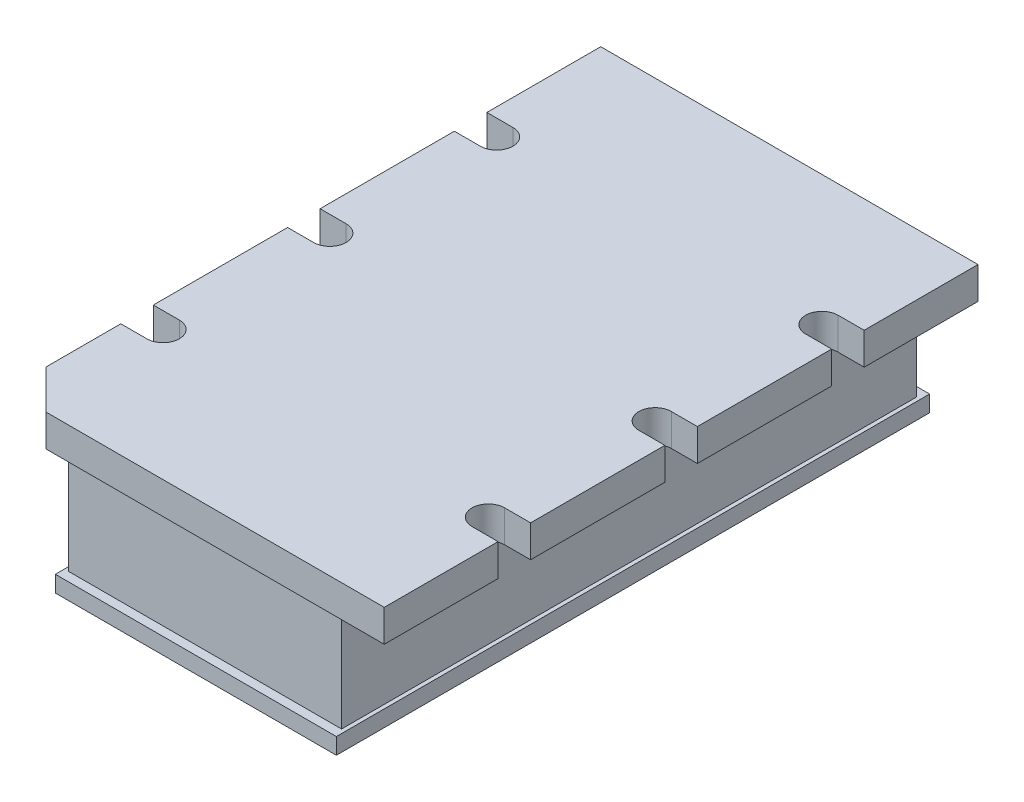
ISO-10303-21;
HEADER;
FILE_DESCRIPTION(('STEP AP214'),'2;1');
FILE_NAME('part.step','',(''),(''),'','','');
FILE_SCHEMA(('AUTOMOTIVE_DESIGN { 1 0 10303 214 1 1 1 1 }'));
ENDSEC;
DATA;
#1=APPLICATION_CONTEXT('core data for automotive mechanical design processes');
#2=APPLICATION_PROTOCOL_DEFINITION('international standard','automotive_design',2000,#1);
#3=PRODUCT_CONTEXT('',#1,'mechanical');
#4=PRODUCT('Part','Part','',(#3));
#5=PRODUCT_RELATED_PRODUCT_CATEGORY('part','',(#4));
#6=PRODUCT_DEFINITION_FORMATION('','',#4);
#7=PRODUCT_DEFINITION_CONTEXT('part definition',#1,'design');
#8=PRODUCT_DEFINITION('design','',#6,#7);
#9=PRODUCT_DEFINITION_SHAPE('','',#8);
#10=(LENGTH_UNIT() NAMED_UNIT(*) SI_UNIT(.MILLI.,.METRE.));
#11=(NAMED_UNIT(*) PLANE_ANGLE_UNIT() SI_UNIT($,.RADIAN.));
#12=(NAMED_UNIT(*) SI_UNIT($,.STERADIAN.) SOLID_ANGLE_UNIT());
#13=UNCERTAINTY_MEASURE_WITH_UNIT(LENGTH_MEASURE(1.E-05),#10,'distance_accuracy_value','');
#14=(GEOMETRIC_REPRESENTATION_CONTEXT(3) GLOBAL_UNCERTAINTY_ASSIGNED_CONTEXT((#13)) GLOBAL_UNIT_ASSIGNED_CONTEXT((#10,
#11,#12)) REPRESENTATION_CONTEXT('',''));
#15=CARTESIAN_POINT('',(0.,0.,0.));
#16=DIRECTION('',(0.,0.,1.));
#17=DIRECTION('',(1.,0.,0.));
#18=AXIS2_PLACEMENT_3D('',#15,#16,#17);
#19=CARTESIAN_POINT('',(-13.716,-11.7475,13.716));
#20=DIRECTION('',(0.,1.,0.));
#21=DIRECTION('',(0.,0.,1.));
#22=AXIS2_PLACEMENT_3D('',#19,#20,#21);
#23=PLANE('',#22);
#24=DIRECTION('',(1.,0.,0.));
#25=VECTOR('',#24,1.);
#26=CARTESIAN_POINT('',(-12.7,-11.7475,-13.716));
#27=LINE('',#26,#25);
#28=CARTESIAN_POINT('',(-13.716,-11.7475,-13.716));
#29=VERTEX_POINT('',#28);
#30=CARTESIAN_POINT('',(-12.7,-11.7475,-13.716));
#31=VERTEX_POINT('',#30);
#32=EDGE_CURVE('E11',#29,#31,#27,.T.);
#33=ORIENTED_EDGE('',*,*,#32,.F.);
#34=DIRECTION('',(0.,0.,-1.));
#35=VECTOR('',#34,1.);
#36=CARTESIAN_POINT('',(-13.716,-11.7475,-13.716));
#37=LINE('',#36,#35);
#38=CARTESIAN_POINT('',(-13.716,-11.7475,-28.956));
#39=VERTEX_POINT('',#38);
#40=EDGE_CURVE('E413',#29,#39,#37,.T.);
#41=ORIENTED_EDGE('',*,*,#40,.T.);
#42=DIRECTION('',(1.,0.,0.));
#43=VECTOR('',#42,1.);
#44=CARTESIAN_POINT('',(-13.716,-11.7475,-28.956));
#45=LINE('',#44,#43);
#46=CARTESIAN_POINT('',(13.716,-11.7475,-28.956));
#47=VERTEX_POINT('',#46);
#48=EDGE_CURVE('E414',#39,#47,#45,.T.);
#49=ORIENTED_EDGE('',*,*,#48,.T.);
#50=DIRECTION('',(0.,0.,1.));
#51=VECTOR('',#50,1.);
#52=CARTESIAN_POINT('',(13.716,-11.7475,28.956));
#53=LINE('',#52,#51);
#54=CARTESIAN_POINT('',(13.716,-11.7475,28.956));
#55=VERTEX_POINT('',#54);
#56=EDGE_CURVE('E417',#47,#55,#53,.T.);
#57=ORIENTED_EDGE('',*,*,#56,.T.);
#58=DIRECTION('',(-1.,0.,0.));
#59=VECTOR('',#58,1.);
#60=CARTESIAN_POINT('',(-13.716,-11.7475,28.956));
#61=LINE('',#60,#59);
#62=CARTESIAN_POINT('',(-13.716,-11.7475,28.956));
#63=VERTEX_POINT('',#62);
#64=EDGE_CURVE('E423',#55,#63,#61,.T.);
#65=ORIENTED_EDGE('',*,*,#64,.T.);
#66=DIRECTION('',(0.,0.,-1.));
#67=VECTOR('',#66,1.);
#68=CARTESIAN_POINT('',(-13.716,-11.7475,28.956));
#69=LINE('',#68,#67);
#70=CARTESIAN_POINT('',(-13.716,-11.7475,13.716));
#71=VERTEX_POINT('',#70);
#72=EDGE_CURVE('E395',#63,#71,#69,.T.);
#73=ORIENTED_EDGE('',*,*,#72,.T.);
#74=DIRECTION('',(-1.,0.,0.));
#75=VECTOR('',#74,1.);
#76=CARTESIAN_POINT('',(-13.716,-11.7475,13.716));
#77=LINE('',#76,#75);
#78=CARTESIAN_POINT('',(-18.6436,-11.7475,13.716));
#79=VERTEX_POINT('',#78);
#80=EDGE_CURVE('E419',#71,#79,#77,.T.);
#81=ORIENTED_EDGE('',*,*,#80,.T.);
#82=DIRECTION('',(0.,0.,-1.));
#83=VECTOR('',#82,1.);
#84=CARTESIAN_POINT('',(-18.6436,-11.7475,13.716));
#85=LINE('',#84,#83);
#86=CARTESIAN_POINT('',(-18.6436,-11.7475,12.954));
#87=VERTEX_POINT('',#86);
#88=EDGE_CURVE('E361',#79,#87,#85,.T.);
#89=ORIENTED_EDGE('',*,*,#88,.T.);
#90=DIRECTION('',(1.,0.,0.));
#91=VECTOR('',#90,1.);
#92=CARTESIAN_POINT('',(-12.7,-11.7475,12.954));
#93=LINE('',#92,#91);
#94=CARTESIAN_POINT('',(-12.7,-11.7475,12.954));
#95=VERTEX_POINT('',#94);
#96=EDGE_CURVE('E41',#87,#95,#93,.T.);
#97=ORIENTED_EDGE('',*,*,#96,.T.);
#98=DIRECTION('',(0.,0.,-1.));
#99=VECTOR('',#98,1.);
#100=CARTESIAN_POINT('',(-12.7,-11.7475,12.954));
#101=LINE('',#100,#99);
#102=EDGE_CURVE('E340',#95,#31,#101,.T.);
#103=ORIENTED_EDGE('',*,*,#102,.T.);
#104=EDGE_LOOP('',(#33,#41,#49,#57,#65,#73,#81,#89,#97,#103));
#105=FACE_BOUND('',#104,.T.);
#106=ADVANCED_FACE('F32',(#105),#23,.F.);
#107=CARTESIAN_POINT('',(-18.415,0.,28.9814));
#108=DIRECTION('',(0.,1.,0.));
#109=DIRECTION('',(0.,0.,1.));
#110=AXIS2_PLACEMENT_3D('',#107,#108,#109);
#111=PLANE('',#110);
#112=DIRECTION('',(1.,0.,0.));
#113=VECTOR('',#112,1.);
#114=CARTESIAN_POINT('',(-18.415,0.,28.9814));
#115=LINE('',#114,#113);
#116=CARTESIAN_POINT('',(-14.605,0.,28.9814));
#117=VERTEX_POINT('',#116);
#118=CARTESIAN_POINT('',(18.415,0.,28.9814));
#119=VERTEX_POINT('',#118);
#120=EDGE_CURVE('E667',#117,#119,#115,.T.);
#121=ORIENTED_EDGE('',*,*,#120,.F.);
#122=DIRECTION('',(0.707106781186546,0.,0.707106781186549));
#123=VECTOR('',#122,1.);
#124=CARTESIAN_POINT('',(-14.605,0.,28.9814));
#125=LINE('',#124,#123);
#126=CARTESIAN_POINT('',(-18.415,0.,25.1714));
#127=VERTEX_POINT('',#126);
#128=EDGE_CURVE('E688',#117,#127,#125,.F.);
#129=ORIENTED_EDGE('',*,*,#128,.T.);
#130=DIRECTION('',(0.,0.,1.));
#131=VECTOR('',#130,1.);
#132=CARTESIAN_POINT('',(-18.415,0.,-28.9814));
#133=LINE('',#132,#131);
#134=CARTESIAN_POINT('',(-18.415,0.,17.8689));
#135=VERTEX_POINT('',#134);
#136=EDGE_CURVE('E641',#135,#127,#133,.T.);
#137=ORIENTED_EDGE('',*,*,#136,.F.);
#138=DIRECTION('',(-1.,0.,0.));
#139=VECTOR('',#138,1.);
#140=CARTESIAN_POINT('',(-1.75676180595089E-13,0.,17.8689));
#141=LINE('',#140,#139);
#142=CARTESIAN_POINT('',(-15.875,0.,17.8689));
#143=VERTEX_POINT('',#142);
#144=EDGE_CURVE('E625',#143,#135,#141,.T.);
#145=ORIENTED_EDGE('',*,*,#144,.F.);
#146=CARTESIAN_POINT('',(-15.875,0.,16.2814));
#147=DIRECTION('',(0.,-1.,0.));
#148=DIRECTION('',(0.,0.,-1.));
#149=AXIS2_PLACEMENT_3D('',#146,#147,#148);
#150=CIRCLE('',#149,1.5875);
#151=CARTESIAN_POINT('',(-15.875,0.,14.6939));
#152=VERTEX_POINT('',#151);
#153=EDGE_CURVE('E634',#152,#143,#150,.T.);
#154=ORIENTED_EDGE('',*,*,#153,.F.);
#155=DIRECTION('',(-1.,0.,0.));
#156=VECTOR('',#155,1.);
#157=CARTESIAN_POINT('',(1.12675508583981E-13,0.,14.6939));
#158=LINE('',#157,#156);
#159=CARTESIAN_POINT('',(-18.415,0.,14.6939));
#160=VERTEX_POINT('',#159);
#161=EDGE_CURVE('E613',#152,#160,#158,.T.);
#162=ORIENTED_EDGE('',*,*,#161,.T.);
#163=CARTESIAN_POINT('',(-18.415,0.,1.5875));
#164=VERTEX_POINT('',#163);
#165=EDGE_CURVE('E782',#164,#160,#133,.T.);
#166=ORIENTED_EDGE('',*,*,#165,.F.);
#167=DIRECTION('',(-1.,0.,0.));
#168=VECTOR('',#167,1.);
#169=CARTESIAN_POINT('',(0.,0.,1.58749999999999));
#170=LINE('',#169,#168);
#171=CARTESIAN_POINT('',(-15.875,0.,1.5875));
#172=VERTEX_POINT('',#171);
#173=EDGE_CURVE('E598',#172,#164,#170,.T.);
#174=ORIENTED_EDGE('',*,*,#173,.F.);
#175=CARTESIAN_POINT('',(-15.875,0.,0.));
#176=DIRECTION('',(0.,-1.,0.));
#177=DIRECTION('',(0.,0.,-1.));
#178=AXIS2_PLACEMENT_3D('',#175,#176,#177);
#179=CIRCLE('',#178,1.5875);
#180=CARTESIAN_POINT('',(-15.875,0.,-1.5875));
#181=VERTEX_POINT('',#180);
#182=EDGE_CURVE('E606',#181,#172,#179,.T.);
#183=ORIENTED_EDGE('',*,*,#182,.F.);
#184=DIRECTION('',(1.,0.,0.));
#185=VECTOR('',#184,1.);
#186=CARTESIAN_POINT('',(0.,0.,-1.58749999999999));
#187=LINE('',#186,#185);
#188=CARTESIAN_POINT('',(-18.415,0.,-1.5875));
#189=VERTEX_POINT('',#188);
#190=EDGE_CURVE('E587',#189,#181,#187,.T.);
#191=ORIENTED_EDGE('',*,*,#190,.F.);
#192=CARTESIAN_POINT('',(-18.415,0.,-14.6939));
#193=VERTEX_POINT('',#192);
#194=EDGE_CURVE('E668',#193,#189,#133,.T.);
#195=ORIENTED_EDGE('',*,*,#194,.F.);
#196=DIRECTION('',(-1.,0.,0.));
#197=VECTOR('',#196,1.);
#198=CARTESIAN_POINT('',(1.12675508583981E-13,0.,-14.6939));
#199=LINE('',#198,#197);
#200=CARTESIAN_POINT('',(-15.875,0.,-14.6939));
#201=VERTEX_POINT('',#200);
#202=EDGE_CURVE('E563',#201,#193,#199,.T.);
#203=ORIENTED_EDGE('',*,*,#202,.F.);
#204=CARTESIAN_POINT('',(-15.875,0.,-16.2814));
#205=DIRECTION('',(0.,1.,0.));
#206=DIRECTION('',(0.,0.,1.));
#207=AXIS2_PLACEMENT_3D('',#204,#205,#206);
#208=CIRCLE('',#207,1.5875);
#209=CARTESIAN_POINT('',(-15.875,0.,-17.8689));
#210=VERTEX_POINT('',#209);
#211=EDGE_CURVE('E574',#201,#210,#208,.T.);
#212=ORIENTED_EDGE('',*,*,#211,.T.);
#213=DIRECTION('',(-1.,0.,0.));
#214=VECTOR('',#213,1.);
#215=CARTESIAN_POINT('',(-1.75676180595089E-13,0.,-17.8689));
#216=LINE('',#215,#214);
#217=CARTESIAN_POINT('',(-18.415,0.,-17.8689));
#218=VERTEX_POINT('',#217);
#219=EDGE_CURVE('E580',#210,#218,#216,.T.);
#220=ORIENTED_EDGE('',*,*,#219,.T.);
#221=CARTESIAN_POINT('',(-18.415,0.,-28.9814));
#222=VERTEX_POINT('',#221);
#223=EDGE_CURVE('E664',#222,#218,#133,.T.);
#224=ORIENTED_EDGE('',*,*,#223,.F.);
#225=DIRECTION('',(-1.,0.,0.));
#226=VECTOR('',#225,1.);
#227=CARTESIAN_POINT('',(-18.415,0.,-28.9814));
#228=LINE('',#227,#226);
#229=CARTESIAN_POINT('',(18.415,0.,-28.9814));
#230=VERTEX_POINT('',#229);
#231=EDGE_CURVE('E674',#230,#222,#228,.T.);
#232=ORIENTED_EDGE('',*,*,#231,.F.);
#233=DIRECTION('',(0.,0.,-1.));
#234=VECTOR('',#233,1.);
#235=CARTESIAN_POINT('',(18.415,0.,-28.9814));
#236=LINE('',#235,#234);
#237=CARTESIAN_POINT('',(18.415,0.,-17.8689));
#238=VERTEX_POINT('',#237);
#239=EDGE_CURVE('E670',#238,#230,#236,.T.);
#240=ORIENTED_EDGE('',*,*,#239,.F.);
#241=DIRECTION('',(1.,0.,0.));
#242=VECTOR('',#241,1.);
#243=CARTESIAN_POINT('',(1.75676180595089E-13,0.,-17.8689));
#244=LINE('',#243,#242);
#245=CARTESIAN_POINT('',(15.875,0.,-17.8689));
#246=VERTEX_POINT('',#245);
#247=EDGE_CURVE('E547',#246,#238,#244,.T.);
#248=ORIENTED_EDGE('',*,*,#247,.F.);
#249=CARTESIAN_POINT('',(15.875,0.,-16.2814));
#250=DIRECTION('',(0.,-1.,0.));
#251=DIRECTION('',(0.,0.,1.));
#252=AXIS2_PLACEMENT_3D('',#249,#250,#251);
#253=CIRCLE('',#252,1.5875);
#254=CARTESIAN_POINT('',(15.875,0.,-14.6939));
#255=VERTEX_POINT('',#254);
#256=EDGE_CURVE('E556',#255,#246,#253,.T.);
#257=ORIENTED_EDGE('',*,*,#256,.F.);
#258=DIRECTION('',(1.,0.,0.));
#259=VECTOR('',#258,1.);
#260=CARTESIAN_POINT('',(-1.12675508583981E-13,0.,-14.6939));
#261=LINE('',#260,#259);
#262=CARTESIAN_POINT('',(18.415,0.,-14.6939));
#263=VERTEX_POINT('',#262);
#264=EDGE_CURVE('E536',#255,#263,#261,.T.);
#265=ORIENTED_EDGE('',*,*,#264,.T.);
#266=CARTESIAN_POINT('',(18.415,0.,-1.5875));
#267=VERTEX_POINT('',#266);
#268=EDGE_CURVE('E1270',#267,#263,#236,.T.);
#269=ORIENTED_EDGE('',*,*,#268,.F.);
#270=DIRECTION('',(1.,0.,0.));
#271=VECTOR('',#270,1.);
#272=CARTESIAN_POINT('',(0.,0.,-1.58749999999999));
#273=LINE('',#272,#271);
#274=CARTESIAN_POINT('',(15.875,0.,-1.5875));
#275=VERTEX_POINT('',#274);
#276=EDGE_CURVE('E520',#275,#267,#273,.T.);
#277=ORIENTED_EDGE('',*,*,#276,.F.);
#278=CARTESIAN_POINT('',(15.875,0.,0.));
#279=DIRECTION('',(0.,-1.,0.));
#280=DIRECTION('',(0.,0.,1.));
#281=AXIS2_PLACEMENT_3D('',#278,#279,#280);
#282=CIRCLE('',#281,1.5875);
#283=CARTESIAN_POINT('',(15.875,0.,1.5875));
#284=VERTEX_POINT('',#283);
#285=EDGE_CURVE('E529',#284,#275,#282,.T.);
#286=ORIENTED_EDGE('',*,*,#285,.F.);
#287=DIRECTION('',(-1.,0.,0.));
#288=VECTOR('',#287,1.);
#289=CARTESIAN_POINT('',(0.,0.,1.58749999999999));
#290=LINE('',#289,#288);
#291=CARTESIAN_POINT('',(18.415,0.,1.5875));
#292=VERTEX_POINT('',#291);
#293=EDGE_CURVE('E509',#292,#284,#290,.T.);
#294=ORIENTED_EDGE('',*,*,#293,.F.);
#295=CARTESIAN_POINT('',(18.415,0.,14.6939));
#296=VERTEX_POINT('',#295);
#297=EDGE_CURVE('E675',#296,#292,#236,.T.);
#298=ORIENTED_EDGE('',*,*,#297,.F.);
#299=DIRECTION('',(1.,0.,0.));
#300=VECTOR('',#299,1.);
#301=CARTESIAN_POINT('',(-1.12675508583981E-13,0.,14.6939));
#302=LINE('',#301,#300);
#303=CARTESIAN_POINT('',(15.875,0.,14.6939));
#304=VERTEX_POINT('',#303);
#305=EDGE_CURVE('E491',#304,#296,#302,.T.);
#306=ORIENTED_EDGE('',*,*,#305,.F.);
#307=CARTESIAN_POINT('',(15.875,0.,16.2814));
#308=DIRECTION('',(0.,1.,0.));
#309=DIRECTION('',(0.,0.,-1.));
#310=AXIS2_PLACEMENT_3D('',#307,#308,#309);
#311=CIRCLE('',#310,1.5875);
#312=CARTESIAN_POINT('',(15.875,0.,17.8689));
#313=VERTEX_POINT('',#312);
#314=EDGE_CURVE('E496',#304,#313,#311,.T.);
#315=ORIENTED_EDGE('',*,*,#314,.T.);
#316=DIRECTION('',(1.,0.,0.));
#317=VECTOR('',#316,1.);
#318=CARTESIAN_POINT('',(1.75676180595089E-13,0.,17.8689));
#319=LINE('',#318,#317);
#320=CARTESIAN_POINT('',(18.415,0.,17.8689));
#321=VERTEX_POINT('',#320);
#322=EDGE_CURVE('E502',#313,#321,#319,.T.);
#323=ORIENTED_EDGE('',*,*,#322,.T.);
#324=EDGE_CURVE('E671',#119,#321,#236,.T.);
#325=ORIENTED_EDGE('',*,*,#324,.F.);
#326=EDGE_LOOP('',(#121,#129,#137,#145,#154,#162,#166,#174,#183,#191,#195,#203,#212,#220,#224,
#232,#240,#248,#257,#265,#269,#277,#286,#294,#298,#306,#315,#323,#325));
#327=FACE_BOUND('',#326,.T.);
#328=DIRECTION('',(0.,0.,-1.));
#329=VECTOR('',#328,1.);
#330=CARTESIAN_POINT('',(-13.335,0.,28.067));
#331=LINE('',#330,#329);
#332=CARTESIAN_POINT('',(-13.335,0.,28.067));
#333=VERTEX_POINT('',#332);
#334=CARTESIAN_POINT('',(-13.335,0.,-28.067));
#335=VERTEX_POINT('',#334);
#336=EDGE_CURVE('E458',#333,#335,#331,.T.);
#337=ORIENTED_EDGE('',*,*,#336,.F.);
#338=DIRECTION('',(-1.,0.,0.));
#339=VECTOR('',#338,1.);
#340=CARTESIAN_POINT('',(-13.335,0.,28.067));
#341=LINE('',#340,#339);
#342=CARTESIAN_POINT('',(13.335,0.,28.067));
#343=VERTEX_POINT('',#342);
#344=EDGE_CURVE('E463',#343,#333,#341,.T.);
#345=ORIENTED_EDGE('',*,*,#344,.F.);
#346=DIRECTION('',(0.,0.,1.));
#347=VECTOR('',#346,1.);
#348=CARTESIAN_POINT('',(13.335,0.,28.067));
#349=LINE('',#348,#347);
#350=CARTESIAN_POINT('',(13.335,0.,-28.067));
#351=VERTEX_POINT('',#350);
#352=EDGE_CURVE('E476',#351,#343,#349,.T.);
#353=ORIENTED_EDGE('',*,*,#352,.F.);
#354=DIRECTION('',(1.,0.,0.));
#355=VECTOR('',#354,1.);
#356=CARTESIAN_POINT('',(-13.335,0.,-28.067));
#357=LINE('',#356,#355);
#358=EDGE_CURVE('E56',#335,#351,#357,.T.);
#359=ORIENTED_EDGE('',*,*,#358,.F.);
#360=EDGE_LOOP('',(#337,#345,#353,#359));
#361=FACE_BOUND('',#360,.T.);
#362=ADVANCED_FACE('F710',(#327,#361),#111,.F.);
#363=CARTESIAN_POINT('',(18.415,3.1242,-28.9814));
#364=DIRECTION('',(-1.,0.,0.));
#365=DIRECTION('',(0.,0.,1.));
#366=AXIS2_PLACEMENT_3D('',#363,#364,#365);
#367=PLANE('',#366);
#368=DIRECTION('',(0.,-1.,0.));
#369=VECTOR('',#368,1.);
#370=CARTESIAN_POINT('',(18.415,3.1242,17.8689));
#371=LINE('',#370,#369);
#372=CARTESIAN_POINT('',(18.415,3.1242,17.8689));
#373=VERTEX_POINT('',#372);
#374=EDGE_CURVE('E512',#373,#321,#371,.T.);
#375=ORIENTED_EDGE('',*,*,#374,.F.);
#376=DIRECTION('',(0.,0.,-1.));
#377=VECTOR('',#376,1.);
#378=CARTESIAN_POINT('',(18.415,3.1242,-28.9814));
#379=LINE('',#378,#377);
#380=CARTESIAN_POINT('',(18.415,3.1242,28.9814));
#381=VERTEX_POINT('',#380);
#382=EDGE_CURVE('E657',#381,#373,#379,.T.);
#383=ORIENTED_EDGE('',*,*,#382,.F.);
#384=DIRECTION('',(0.,-1.,0.));
#385=VECTOR('',#384,1.);
#386=CARTESIAN_POINT('',(18.415,3.1242,28.9814));
#387=LINE('',#386,#385);
#388=EDGE_CURVE('E682',#381,#119,#387,.T.);
#389=ORIENTED_EDGE('',*,*,#388,.T.);
#390=ORIENTED_EDGE('',*,*,#324,.T.);
#391=EDGE_LOOP('',(#375,#383,#389,#390));
#392=FACE_BOUND('',#391,.T.);
#393=ADVANCED_FACE('F714',(#392),#367,.F.);
#394=CARTESIAN_POINT('',(18.415,3.1242,14.6939));
#395=VERTEX_POINT('',#394);
#396=CARTESIAN_POINT('',(18.415,3.1242,1.5875));
#397=VERTEX_POINT('',#396);
#398=EDGE_CURVE('E661',#395,#397,#379,.T.);
#399=ORIENTED_EDGE('',*,*,#398,.F.);
#400=DIRECTION('',(0.,-1.,0.));
#401=VECTOR('',#400,1.);
#402=CARTESIAN_POINT('',(18.415,3.1242,14.6939));
#403=LINE('',#402,#401);
#404=EDGE_CURVE('E500',#395,#296,#403,.T.);
#405=ORIENTED_EDGE('',*,*,#404,.T.);
#406=ORIENTED_EDGE('',*,*,#297,.T.);
#407=DIRECTION('',(0.,-1.,0.));
#408=VECTOR('',#407,1.);
#409=CARTESIAN_POINT('',(18.415,3.1242,1.5875));
#410=LINE('',#409,#408);
#411=EDGE_CURVE('E533',#397,#292,#410,.T.);
#412=ORIENTED_EDGE('',*,*,#411,.F.);
#413=EDGE_LOOP('',(#399,#405,#406,#412));
#414=FACE_BOUND('',#413,.T.);
#415=ADVANCED_FACE('F732',(#414),#367,.F.);
#416=CARTESIAN_POINT('',(-18.415,3.1242,28.9814));
#417=DIRECTION('',(0.,1.,0.));
#418=DIRECTION('',(0.,0.,1.));
#419=AXIS2_PLACEMENT_3D('',#416,#417,#418);
#420=PLANE('',#419);
#421=DIRECTION('',(0.,0.,1.));
#422=VECTOR('',#421,1.);
#423=CARTESIAN_POINT('',(-18.415,3.1242,-28.9814));
#424=LINE('',#423,#422);
#425=CARTESIAN_POINT('',(-18.415,3.1242,17.8689));
#426=VERTEX_POINT('',#425);
#427=CARTESIAN_POINT('',(-18.415,3.1242,25.1714));
#428=VERTEX_POINT('',#427);
#429=EDGE_CURVE('E654',#426,#428,#424,.T.);
#430=ORIENTED_EDGE('',*,*,#429,.T.);
#431=DIRECTION('',(-0.707106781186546,0.,-0.707106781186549));
#432=VECTOR('',#431,1.);
#433=CARTESIAN_POINT('',(-16.51,3.1242,27.0764));
#434=LINE('',#433,#432);
#435=CARTESIAN_POINT('',(-14.605,3.1242,28.9814));
#436=VERTEX_POINT('',#435);
#437=EDGE_CURVE('E362',#428,#436,#434,.F.);
#438=ORIENTED_EDGE('',*,*,#437,.T.);
#439=DIRECTION('',(1.,0.,0.));
#440=VECTOR('',#439,1.);
#441=CARTESIAN_POINT('',(-18.415,3.1242,28.9814));
#442=LINE('',#441,#440);
#443=EDGE_CURVE('E652',#436,#381,#442,.T.);
#444=ORIENTED_EDGE('',*,*,#443,.T.);
#445=ORIENTED_EDGE('',*,*,#382,.T.);
#446=DIRECTION('',(1.,0.,0.));
#447=VECTOR('',#446,1.);
#448=CARTESIAN_POINT('',(1.75676180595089E-13,3.1242,17.8689));
#449=LINE('',#448,#447);
#450=CARTESIAN_POINT('',(15.875,3.1242,17.8689));
#451=VERTEX_POINT('',#450);
#452=EDGE_CURVE('E495',#451,#373,#449,.T.);
#453=ORIENTED_EDGE('',*,*,#452,.F.);
#454=CARTESIAN_POINT('',(15.875,3.1242,16.2814));
#455=DIRECTION('',(0.,1.,0.));
#456=DIRECTION('',(0.,0.,-1.));
#457=AXIS2_PLACEMENT_3D('',#454,#455,#456);
#458=CIRCLE('',#457,1.5875);
#459=CARTESIAN_POINT('',(15.875,3.1242,14.6939));
#460=VERTEX_POINT('',#459);
#461=EDGE_CURVE('E498',#460,#451,#458,.T.);
#462=ORIENTED_EDGE('',*,*,#461,.F.);
#463=DIRECTION('',(1.,0.,0.));
#464=VECTOR('',#463,1.);
#465=CARTESIAN_POINT('',(-1.12675508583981E-13,3.1242,14.6939));
#466=LINE('',#465,#464);
#467=EDGE_CURVE('E492',#460,#395,#466,.T.);
#468=ORIENTED_EDGE('',*,*,#467,.T.);
#469=ORIENTED_EDGE('',*,*,#398,.T.);
#470=DIRECTION('',(-1.,0.,0.));
#471=VECTOR('',#470,1.);
#472=CARTESIAN_POINT('',(0.,3.1242,1.58749999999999));
#473=LINE('',#472,#471);
#474=CARTESIAN_POINT('',(15.875,3.1242,1.5875));
#475=VERTEX_POINT('',#474);
#476=EDGE_CURVE('E516',#397,#475,#473,.T.);
#477=ORIENTED_EDGE('',*,*,#476,.T.);
#478=CARTESIAN_POINT('',(15.875,3.1242,0.));
#479=DIRECTION('',(0.,-1.,0.));
#480=DIRECTION('',(0.,0.,1.));
#481=AXIS2_PLACEMENT_3D('',#478,#479,#480);
#482=CIRCLE('',#481,1.5875);
#483=CARTESIAN_POINT('',(15.875,3.1242,-1.5875));
#484=VERTEX_POINT('',#483);
#485=EDGE_CURVE('E519',#475,#484,#482,.T.);
#486=ORIENTED_EDGE('',*,*,#485,.T.);
#487=DIRECTION('',(1.,0.,0.));
#488=VECTOR('',#487,1.);
#489=CARTESIAN_POINT('',(0.,3.1242,-1.58749999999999));
#490=LINE('',#489,#488);
#491=CARTESIAN_POINT('',(18.415,3.1242,-1.5875));
#492=VERTEX_POINT('',#491);
#493=EDGE_CURVE('E523',#484,#492,#490,.T.);
#494=ORIENTED_EDGE('',*,*,#493,.T.);
#495=CARTESIAN_POINT('',(18.415,3.1242,-14.6939));
#496=VERTEX_POINT('',#495);
#497=EDGE_CURVE('E734',#492,#496,#379,.T.);
#498=ORIENTED_EDGE('',*,*,#497,.T.);
#499=DIRECTION('',(1.,0.,0.));
#500=VECTOR('',#499,1.);
#501=CARTESIAN_POINT('',(-1.12675508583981E-13,3.1242,-14.6939));
#502=LINE('',#501,#500);
#503=CARTESIAN_POINT('',(15.875,3.1242,-14.6939));
#504=VERTEX_POINT('',#503);
#505=EDGE_CURVE('E543',#504,#496,#502,.T.);
#506=ORIENTED_EDGE('',*,*,#505,.F.);
#507=CARTESIAN_POINT('',(15.875,3.1242,-16.2814));
#508=DIRECTION('',(0.,-1.,0.));
#509=DIRECTION('',(0.,0.,1.));
#510=AXIS2_PLACEMENT_3D('',#507,#508,#509);
#511=CIRCLE('',#510,1.5875);
#512=CARTESIAN_POINT('',(15.875,3.1242,-17.8689));
#513=VERTEX_POINT('',#512);
#514=EDGE_CURVE('E546',#504,#513,#511,.T.);
#515=ORIENTED_EDGE('',*,*,#514,.T.);
#516=DIRECTION('',(1.,0.,0.));
#517=VECTOR('',#516,1.);
#518=CARTESIAN_POINT('',(1.75676180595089E-13,3.1242,-17.8689));
#519=LINE('',#518,#517);
#520=CARTESIAN_POINT('',(18.415,3.1242,-17.8689));
#521=VERTEX_POINT('',#520);
#522=EDGE_CURVE('E550',#513,#521,#519,.T.);
#523=ORIENTED_EDGE('',*,*,#522,.T.);
#524=CARTESIAN_POINT('',(18.415,3.1242,-28.9814));
#525=VERTEX_POINT('',#524);
#526=EDGE_CURVE('E656',#521,#525,#379,.T.);
#527=ORIENTED_EDGE('',*,*,#526,.T.);
#528=DIRECTION('',(-1.,0.,0.));
#529=VECTOR('',#528,1.);
#530=CARTESIAN_POINT('',(-18.415,3.1242,-28.9814));
#531=LINE('',#530,#529);
#532=CARTESIAN_POINT('',(-18.415,3.1242,-28.9814));
#533=VERTEX_POINT('',#532);
#534=EDGE_CURVE('E660',#525,#533,#531,.T.);
#535=ORIENTED_EDGE('',*,*,#534,.T.);
#536=CARTESIAN_POINT('',(-18.415,3.1242,-17.8689));
#537=VERTEX_POINT('',#536);
#538=EDGE_CURVE('E649',#533,#537,#424,.T.);
#539=ORIENTED_EDGE('',*,*,#538,.T.);
#540=DIRECTION('',(-1.,0.,0.));
#541=VECTOR('',#540,1.);
#542=CARTESIAN_POINT('',(-1.75676180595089E-13,3.1242,-17.8689));
#543=LINE('',#542,#541);
#544=CARTESIAN_POINT('',(-15.875,3.1242,-17.8689));
#545=VERTEX_POINT('',#544);
#546=EDGE_CURVE('E573',#545,#537,#543,.T.);
#547=ORIENTED_EDGE('',*,*,#546,.F.);
#548=CARTESIAN_POINT('',(-15.875,3.1242,-16.2814));
#549=DIRECTION('',(0.,1.,0.));
#550=DIRECTION('',(0.,0.,1.));
#551=AXIS2_PLACEMENT_3D('',#548,#549,#550);
#552=CIRCLE('',#551,1.5875);
#553=CARTESIAN_POINT('',(-15.875,3.1242,-14.6939));
#554=VERTEX_POINT('',#553);
#555=EDGE_CURVE('E576',#554,#545,#552,.T.);
#556=ORIENTED_EDGE('',*,*,#555,.F.);
#557=DIRECTION('',(-1.,0.,0.));
#558=VECTOR('',#557,1.);
#559=CARTESIAN_POINT('',(1.12675508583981E-13,3.1242,-14.6939));
#560=LINE('',#559,#558);
#561=CARTESIAN_POINT('',(-18.415,3.1242,-14.6939));
#562=VERTEX_POINT('',#561);
#563=EDGE_CURVE('E570',#554,#562,#560,.T.);
#564=ORIENTED_EDGE('',*,*,#563,.T.);
#565=CARTESIAN_POINT('',(-18.415,3.1242,-1.5875));
#566=VERTEX_POINT('',#565);
#567=EDGE_CURVE('E653',#562,#566,#424,.T.);
#568=ORIENTED_EDGE('',*,*,#567,.T.);
#569=DIRECTION('',(1.,0.,0.));
#570=VECTOR('',#569,1.);
#571=CARTESIAN_POINT('',(0.,3.1242,-1.58749999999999));
#572=LINE('',#571,#570);
#573=CARTESIAN_POINT('',(-15.875,3.1242,-1.5875));
#574=VERTEX_POINT('',#573);
#575=EDGE_CURVE('E594',#566,#574,#572,.T.);
#576=ORIENTED_EDGE('',*,*,#575,.T.);
#577=CARTESIAN_POINT('',(-15.875,3.1242,0.));
#578=DIRECTION('',(0.,-1.,0.));
#579=DIRECTION('',(0.,0.,-1.));
#580=AXIS2_PLACEMENT_3D('',#577,#578,#579);
#581=CIRCLE('',#580,1.5875);
#582=CARTESIAN_POINT('',(-15.875,3.1242,1.5875));
#583=VERTEX_POINT('',#582);
#584=EDGE_CURVE('E597',#574,#583,#581,.T.);
#585=ORIENTED_EDGE('',*,*,#584,.T.);
#586=DIRECTION('',(-1.,0.,0.));
#587=VECTOR('',#586,1.);
#588=CARTESIAN_POINT('',(0.,3.1242,1.58749999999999));
#589=LINE('',#588,#587);
#590=CARTESIAN_POINT('',(-18.415,3.1242,1.5875));
#591=VERTEX_POINT('',#590);
#592=EDGE_CURVE('E601',#583,#591,#589,.T.);
#593=ORIENTED_EDGE('',*,*,#592,.T.);
#594=CARTESIAN_POINT('',(-18.415,3.1242,14.6939));
#595=VERTEX_POINT('',#594);
#596=EDGE_CURVE('E702',#591,#595,#424,.T.);
#597=ORIENTED_EDGE('',*,*,#596,.T.);
#598=DIRECTION('',(-1.,0.,0.));
#599=VECTOR('',#598,1.);
#600=CARTESIAN_POINT('',(1.12675508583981E-13,3.1242,14.6939));
#601=LINE('',#600,#599);
#602=CARTESIAN_POINT('',(-15.875,3.1242,14.6939));
#603=VERTEX_POINT('',#602);
#604=EDGE_CURVE('E621',#603,#595,#601,.T.);
#605=ORIENTED_EDGE('',*,*,#604,.F.);
#606=CARTESIAN_POINT('',(-15.875,3.1242,16.2814));
#607=DIRECTION('',(0.,-1.,0.));
#608=DIRECTION('',(0.,0.,-1.));
#609=AXIS2_PLACEMENT_3D('',#606,#607,#608);
#610=CIRCLE('',#609,1.5875);
#611=CARTESIAN_POINT('',(-15.875,3.1242,17.8689));
#612=VERTEX_POINT('',#611);
#613=EDGE_CURVE('E624',#603,#612,#610,.T.);
#614=ORIENTED_EDGE('',*,*,#613,.T.);
#615=DIRECTION('',(-1.,0.,0.));
#616=VECTOR('',#615,1.);
#617=CARTESIAN_POINT('',(-1.75676180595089E-13,3.1242,17.8689));
#618=LINE('',#617,#616);
#619=EDGE_CURVE('E628',#612,#426,#618,.T.);
#620=ORIENTED_EDGE('',*,*,#619,.T.);
#621=EDGE_LOOP('',(#430,#438,#444,#445,#453,#462,#468,#469,#477,#486,#494,#498,#506,#515,#523,
#527,#535,#539,#547,#556,#564,#568,#576,#585,#593,#597,#605,#614,#620));
#622=FACE_BOUND('',#621,.T.);
#623=ADVANCED_FACE('F699',(#622),#420,.T.);
#624=ORIENTED_EDGE('',*,*,#497,.F.);
#625=DIRECTION('',(0.,-1.,0.));
#626=VECTOR('',#625,1.);
#627=CARTESIAN_POINT('',(18.415,3.1242,-1.5875));
#628=LINE('',#627,#626);
#629=EDGE_CURVE('E537',#492,#267,#628,.T.);
#630=ORIENTED_EDGE('',*,*,#629,.T.);
#631=ORIENTED_EDGE('',*,*,#268,.T.);
#632=DIRECTION('',(0.,-1.,0.));
#633=VECTOR('',#632,1.);
#634=CARTESIAN_POINT('',(18.415,3.1242,-14.6939));
#635=LINE('',#634,#633);
#636=EDGE_CURVE('E560',#496,#263,#635,.T.);
#637=ORIENTED_EDGE('',*,*,#636,.F.);
#638=EDGE_LOOP('',(#624,#630,#631,#637));
#639=FACE_BOUND('',#638,.T.);
#640=ADVANCED_FACE('F1152',(#639),#367,.F.);
#641=CARTESIAN_POINT('',(-18.415,3.1242,-28.9814));
#642=DIRECTION('',(1.,0.,0.));
#643=DIRECTION('',(0.,0.,-1.));
#644=AXIS2_PLACEMENT_3D('',#641,#642,#643);
#645=PLANE('',#644);
#646=DIRECTION('',(0.,-1.,0.));
#647=VECTOR('',#646,1.);
#648=CARTESIAN_POINT('',(-18.415,3.1242,-17.8689));
#649=LINE('',#648,#647);
#650=EDGE_CURVE('E590',#537,#218,#649,.T.);
#651=ORIENTED_EDGE('',*,*,#650,.F.);
#652=ORIENTED_EDGE('',*,*,#538,.F.);
#653=DIRECTION('',(0.,-1.,0.));
#654=VECTOR('',#653,1.);
#655=CARTESIAN_POINT('',(-18.415,3.1242,-28.9814));
#656=LINE('',#655,#654);
#657=EDGE_CURVE('E663',#533,#222,#656,.T.);
#658=ORIENTED_EDGE('',*,*,#657,.T.);
#659=ORIENTED_EDGE('',*,*,#223,.T.);
#660=EDGE_LOOP('',(#651,#652,#658,#659));
#661=FACE_BOUND('',#660,.T.);
#662=ADVANCED_FACE('F752',(#661),#645,.F.);
#663=ORIENTED_EDGE('',*,*,#567,.F.);
#664=DIRECTION('',(0.,-1.,0.));
#665=VECTOR('',#664,1.);
#666=CARTESIAN_POINT('',(-18.415,3.1242,-14.6939));
#667=LINE('',#666,#665);
#668=EDGE_CURVE('E578',#562,#193,#667,.T.);
#669=ORIENTED_EDGE('',*,*,#668,.T.);
#670=ORIENTED_EDGE('',*,*,#194,.T.);
#671=DIRECTION('',(0.,-1.,0.));
#672=VECTOR('',#671,1.);
#673=CARTESIAN_POINT('',(-18.415,3.1242,-1.5875));
#674=LINE('',#673,#672);
#675=EDGE_CURVE('E610',#566,#189,#674,.T.);
#676=ORIENTED_EDGE('',*,*,#675,.F.);
#677=EDGE_LOOP('',(#663,#669,#670,#676));
#678=FACE_BOUND('',#677,.T.);
#679=ADVANCED_FACE('F770',(#678),#645,.F.);
#680=ORIENTED_EDGE('',*,*,#596,.F.);
#681=DIRECTION('',(0.,-1.,0.));
#682=VECTOR('',#681,1.);
#683=CARTESIAN_POINT('',(-18.415,3.1242,1.5875));
#684=LINE('',#683,#682);
#685=EDGE_CURVE('E614',#591,#164,#684,.T.);
#686=ORIENTED_EDGE('',*,*,#685,.T.);
#687=ORIENTED_EDGE('',*,*,#165,.T.);
#688=DIRECTION('',(0.,-1.,0.));
#689=VECTOR('',#688,1.);
#690=CARTESIAN_POINT('',(-18.415,3.1242,14.6939));
#691=LINE('',#690,#689);
#692=EDGE_CURVE('E638',#595,#160,#691,.T.);
#693=ORIENTED_EDGE('',*,*,#692,.F.);
#694=EDGE_LOOP('',(#680,#686,#687,#693));
#695=FACE_BOUND('',#694,.T.);
#696=ADVANCED_FACE('F780',(#695),#645,.F.);
#697=ORIENTED_EDGE('',*,*,#136,.T.);
#698=DIRECTION('',(0.,1.,0.));
#699=VECTOR('',#698,1.);
#700=CARTESIAN_POINT('',(-18.415,3.1242,25.1714));
#701=LINE('',#700,#699);
#702=EDGE_CURVE('E364',#127,#428,#701,.T.);
#703=ORIENTED_EDGE('',*,*,#702,.T.);
#704=ORIENTED_EDGE('',*,*,#429,.F.);
#705=DIRECTION('',(0.,-1.,0.));
#706=VECTOR('',#705,1.);
#707=CARTESIAN_POINT('',(-18.415,3.1242,17.8689));
#708=LINE('',#707,#706);
#709=EDGE_CURVE('E642',#426,#135,#708,.T.);
#710=ORIENTED_EDGE('',*,*,#709,.T.);
#711=EDGE_LOOP('',(#697,#703,#704,#710));
#712=FACE_BOUND('',#711,.T.);
#713=ADVANCED_FACE('F694',(#712),#645,.F.);
#714=CARTESIAN_POINT('',(-18.415,3.1242,28.9814));
#715=DIRECTION('',(0.,0.,-1.));
#716=DIRECTION('',(-1.,0.,0.));
#717=AXIS2_PLACEMENT_3D('',#714,#715,#716);
#718=PLANE('',#717);
#719=ORIENTED_EDGE('',*,*,#443,.F.);
#720=DIRECTION('',(0.,-1.,0.));
#721=VECTOR('',#720,1.);
#722=CARTESIAN_POINT('',(-14.605,3.1242,28.9814));
#723=LINE('',#722,#721);
#724=EDGE_CURVE('E685',#436,#117,#723,.T.);
#725=ORIENTED_EDGE('',*,*,#724,.T.);
#726=ORIENTED_EDGE('',*,*,#120,.T.);
#727=ORIENTED_EDGE('',*,*,#388,.F.);
#728=EDGE_LOOP('',(#719,#725,#726,#727));
#729=FACE_BOUND('',#728,.T.);
#730=ADVANCED_FACE('F706',(#729),#718,.F.);
#731=ORIENTED_EDGE('',*,*,#526,.F.);
#732=DIRECTION('',(0.,-1.,0.));
#733=VECTOR('',#732,1.);
#734=CARTESIAN_POINT('',(18.415,3.1242,-17.8689));
#735=LINE('',#734,#733);
#736=EDGE_CURVE('E564',#521,#238,#735,.T.);
#737=ORIENTED_EDGE('',*,*,#736,.T.);
#738=ORIENTED_EDGE('',*,*,#239,.T.);
#739=DIRECTION('',(0.,-1.,0.));
#740=VECTOR('',#739,1.);
#741=CARTESIAN_POINT('',(18.415,3.1242,-28.9814));
#742=LINE('',#741,#740);
#743=EDGE_CURVE('E679',#525,#230,#742,.T.);
#744=ORIENTED_EDGE('',*,*,#743,.F.);
#745=EDGE_LOOP('',(#731,#737,#738,#744));
#746=FACE_BOUND('',#745,.T.);
#747=ADVANCED_FACE('F743',(#746),#367,.F.);
#748=CARTESIAN_POINT('',(-18.415,3.1242,-28.9814));
#749=DIRECTION('',(0.,0.,1.));
#750=DIRECTION('',(1.,0.,0.));
#751=AXIS2_PLACEMENT_3D('',#748,#749,#750);
#752=PLANE('',#751);
#753=ORIENTED_EDGE('',*,*,#231,.T.);
#754=ORIENTED_EDGE('',*,*,#657,.F.);
#755=ORIENTED_EDGE('',*,*,#534,.F.);
#756=ORIENTED_EDGE('',*,*,#743,.T.);
#757=EDGE_LOOP('',(#753,#754,#755,#756));
#758=FACE_BOUND('',#757,.T.);
#759=ADVANCED_FACE('F747',(#758),#752,.F.);
#760=CARTESIAN_POINT('',(1.12675508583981E-13,3.1242,14.6939));
#761=DIRECTION('',(0.,0.,1.));
#762=DIRECTION('',(1.,0.,0.));
#763=AXIS2_PLACEMENT_3D('',#760,#761,#762);
#764=PLANE('',#763);
#765=ORIENTED_EDGE('',*,*,#161,.F.);
#766=DIRECTION('',(0.,-1.,0.));
#767=VECTOR('',#766,1.);
#768=CARTESIAN_POINT('',(-15.875,3.1242,14.6939));
#769=LINE('',#768,#767);
#770=EDGE_CURVE('E631',#603,#152,#769,.T.);
#771=ORIENTED_EDGE('',*,*,#770,.F.);
#772=ORIENTED_EDGE('',*,*,#604,.T.);
#773=ORIENTED_EDGE('',*,*,#692,.T.);
#774=EDGE_LOOP('',(#765,#771,#772,#773));
#775=FACE_BOUND('',#774,.T.);
#776=ADVANCED_FACE('F778',(#775),#764,.T.);
#777=CARTESIAN_POINT('',(-1.75676180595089E-13,3.1242,17.8689));
#778=DIRECTION('',(0.,0.,1.));
#779=DIRECTION('',(1.,0.,0.));
#780=AXIS2_PLACEMENT_3D('',#777,#778,#779);
#781=PLANE('',#780);
#782=ORIENTED_EDGE('',*,*,#144,.T.);
#783=ORIENTED_EDGE('',*,*,#709,.F.);
#784=ORIENTED_EDGE('',*,*,#619,.F.);
#785=DIRECTION('',(0.,-1.,0.));
#786=VECTOR('',#785,1.);
#787=CARTESIAN_POINT('',(-15.875,3.1242,17.8689));
#788=LINE('',#787,#786);
#789=EDGE_CURVE('E645',#612,#143,#788,.T.);
#790=ORIENTED_EDGE('',*,*,#789,.T.);
#791=EDGE_LOOP('',(#782,#783,#784,#790));
#792=FACE_BOUND('',#791,.T.);
#793=ADVANCED_FACE('F1198',(#792),#781,.F.);
#794=CARTESIAN_POINT('',(-15.875,3.1242,16.2814));
#795=DIRECTION('',(0.,-1.,0.));
#796=DIRECTION('',(0.,0.,-1.));
#797=AXIS2_PLACEMENT_3D('',#794,#795,#796);
#798=CYLINDRICAL_SURFACE('',#797,1.5875);
#799=ORIENTED_EDGE('',*,*,#153,.T.);
#800=ORIENTED_EDGE('',*,*,#789,.F.);
#801=ORIENTED_EDGE('',*,*,#613,.F.);
#802=ORIENTED_EDGE('',*,*,#770,.T.);
#803=EDGE_LOOP('',(#799,#800,#801,#802));
#804=FACE_BOUND('',#803,.T.);
#805=ADVANCED_FACE('F800',(#804),#798,.F.);
#806=CARTESIAN_POINT('',(0.,3.1242,-1.58749999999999));
#807=DIRECTION('',(0.,0.,-1.));
#808=DIRECTION('',(-1.,0.,0.));
#809=AXIS2_PLACEMENT_3D('',#806,#807,#808);
#810=PLANE('',#809);
#811=ORIENTED_EDGE('',*,*,#190,.T.);
#812=DIRECTION('',(0.,-1.,0.));
#813=VECTOR('',#812,1.);
#814=CARTESIAN_POINT('',(-15.875,3.1242,-1.5875));
#815=LINE('',#814,#813);
#816=EDGE_CURVE('E604',#574,#181,#815,.T.);
#817=ORIENTED_EDGE('',*,*,#816,.F.);
#818=ORIENTED_EDGE('',*,*,#575,.F.);
#819=ORIENTED_EDGE('',*,*,#675,.T.);
#820=EDGE_LOOP('',(#811,#817,#818,#819));
#821=FACE_BOUND('',#820,.T.);
#822=ADVANCED_FACE('F786',(#821),#810,.F.);
#823=CARTESIAN_POINT('',(0.,3.1242,1.58749999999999));
#824=DIRECTION('',(0.,0.,1.));
#825=DIRECTION('',(1.,0.,0.));
#826=AXIS2_PLACEMENT_3D('',#823,#824,#825);
#827=PLANE('',#826);
#828=ORIENTED_EDGE('',*,*,#173,.T.);
#829=ORIENTED_EDGE('',*,*,#685,.F.);
#830=ORIENTED_EDGE('',*,*,#592,.F.);
#831=DIRECTION('',(0.,-1.,0.));
#832=VECTOR('',#831,1.);
#833=CARTESIAN_POINT('',(-15.875,3.1242,1.5875));
#834=LINE('',#833,#832);
#835=EDGE_CURVE('E617',#583,#172,#834,.T.);
#836=ORIENTED_EDGE('',*,*,#835,.T.);
#837=EDGE_LOOP('',(#828,#829,#830,#836));
#838=FACE_BOUND('',#837,.T.);
#839=ADVANCED_FACE('F792',(#838),#827,.F.);
#840=CARTESIAN_POINT('',(-15.875,3.1242,0.));
#841=DIRECTION('',(0.,-1.,0.));
#842=DIRECTION('',(0.,0.,-1.));
#843=AXIS2_PLACEMENT_3D('',#840,#841,#842);
#844=CYLINDRICAL_SURFACE('',#843,1.5875);
#845=ORIENTED_EDGE('',*,*,#182,.T.);
#846=ORIENTED_EDGE('',*,*,#835,.F.);
#847=ORIENTED_EDGE('',*,*,#584,.F.);
#848=ORIENTED_EDGE('',*,*,#816,.T.);
#849=EDGE_LOOP('',(#845,#846,#847,#848));
#850=FACE_BOUND('',#849,.T.);
#851=ADVANCED_FACE('F789',(#850),#844,.F.);
#852=CARTESIAN_POINT('',(1.12675508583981E-13,3.1242,-14.6939));
#853=DIRECTION('',(0.,0.,1.));
#854=DIRECTION('',(1.,0.,0.));
#855=AXIS2_PLACEMENT_3D('',#852,#853,#854);
#856=PLANE('',#855);
#857=ORIENTED_EDGE('',*,*,#202,.T.);
#858=ORIENTED_EDGE('',*,*,#668,.F.);
#859=ORIENTED_EDGE('',*,*,#563,.F.);
#860=DIRECTION('',(0.,-1.,0.));
#861=VECTOR('',#860,1.);
#862=CARTESIAN_POINT('',(-15.875,3.1242,-14.6939));
#863=LINE('',#862,#861);
#864=EDGE_CURVE('E585',#554,#201,#863,.T.);
#865=ORIENTED_EDGE('',*,*,#864,.T.);
#866=EDGE_LOOP('',(#857,#858,#859,#865));
#867=FACE_BOUND('',#866,.T.);
#868=ADVANCED_FACE('F765',(#867),#856,.F.);
#869=CARTESIAN_POINT('',(-15.875,3.1242,-16.2814));
#870=DIRECTION('',(0.,-1.,0.));
#871=DIRECTION('',(0.,0.,-1.));
#872=AXIS2_PLACEMENT_3D('',#869,#870,#871);
#873=CYLINDRICAL_SURFACE('',#872,1.5875);
#874=ORIENTED_EDGE('',*,*,#211,.F.);
#875=ORIENTED_EDGE('',*,*,#864,.F.);
#876=ORIENTED_EDGE('',*,*,#555,.T.);
#877=DIRECTION('',(0.,-1.,0.));
#878=VECTOR('',#877,1.);
#879=CARTESIAN_POINT('',(-15.875,3.1242,-17.8689));
#880=LINE('',#879,#878);
#881=EDGE_CURVE('E588',#545,#210,#880,.T.);
#882=ORIENTED_EDGE('',*,*,#881,.T.);
#883=EDGE_LOOP('',(#874,#875,#876,#882));
#884=FACE_BOUND('',#883,.T.);
#885=ADVANCED_FACE('F761',(#884),#873,.F.);
#886=CARTESIAN_POINT('',(-1.75676180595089E-13,3.1242,-17.8689));
#887=DIRECTION('',(0.,0.,1.));
#888=DIRECTION('',(1.,0.,0.));
#889=AXIS2_PLACEMENT_3D('',#886,#887,#888);
#890=PLANE('',#889);
#891=ORIENTED_EDGE('',*,*,#219,.F.);
#892=ORIENTED_EDGE('',*,*,#881,.F.);
#893=ORIENTED_EDGE('',*,*,#546,.T.);
#894=ORIENTED_EDGE('',*,*,#650,.T.);
#895=EDGE_LOOP('',(#891,#892,#893,#894));
#896=FACE_BOUND('',#895,.T.);
#897=ADVANCED_FACE('F758',(#896),#890,.T.);
#898=CARTESIAN_POINT('',(-1.12675508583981E-13,3.1242,-14.6939));
#899=DIRECTION('',(0.,0.,-1.));
#900=DIRECTION('',(-1.,0.,0.));
#901=AXIS2_PLACEMENT_3D('',#898,#899,#900);
#902=PLANE('',#901);
#903=ORIENTED_EDGE('',*,*,#264,.F.);
#904=DIRECTION('',(0.,-1.,0.));
#905=VECTOR('',#904,1.);
#906=CARTESIAN_POINT('',(15.875,3.1242,-14.6939));
#907=LINE('',#906,#905);
#908=EDGE_CURVE('E553',#504,#255,#907,.T.);
#909=ORIENTED_EDGE('',*,*,#908,.F.);
#910=ORIENTED_EDGE('',*,*,#505,.T.);
#911=ORIENTED_EDGE('',*,*,#636,.T.);
#912=EDGE_LOOP('',(#903,#909,#910,#911));
#913=FACE_BOUND('',#912,.T.);
#914=ADVANCED_FACE('F886',(#913),#902,.T.);
#915=CARTESIAN_POINT('',(1.75676180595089E-13,3.1242,-17.8689));
#916=DIRECTION('',(0.,0.,-1.));
#917=DIRECTION('',(-1.,0.,0.));
#918=AXIS2_PLACEMENT_3D('',#915,#916,#917);
#919=PLANE('',#918);
#920=ORIENTED_EDGE('',*,*,#247,.T.);
#921=ORIENTED_EDGE('',*,*,#736,.F.);
#922=ORIENTED_EDGE('',*,*,#522,.F.);
#923=DIRECTION('',(0.,-1.,0.));
#924=VECTOR('',#923,1.);
#925=CARTESIAN_POINT('',(15.875,3.1242,-17.8689));
#926=LINE('',#925,#924);
#927=EDGE_CURVE('E567',#513,#246,#926,.T.);
#928=ORIENTED_EDGE('',*,*,#927,.T.);
#929=EDGE_LOOP('',(#920,#921,#922,#928));
#930=FACE_BOUND('',#929,.T.);
#931=ADVANCED_FACE('F883',(#930),#919,.F.);
#932=CARTESIAN_POINT('',(15.875,3.1242,-16.2814));
#933=DIRECTION('',(0.,-1.,0.));
#934=DIRECTION('',(0.,0.,-1.));
#935=AXIS2_PLACEMENT_3D('',#932,#933,#934);
#936=CYLINDRICAL_SURFACE('',#935,1.5875);
#937=ORIENTED_EDGE('',*,*,#256,.T.);
#938=ORIENTED_EDGE('',*,*,#927,.F.);
#939=ORIENTED_EDGE('',*,*,#514,.F.);
#940=ORIENTED_EDGE('',*,*,#908,.T.);
#941=EDGE_LOOP('',(#937,#938,#939,#940));
#942=FACE_BOUND('',#941,.T.);
#943=ADVANCED_FACE('F881',(#942),#936,.F.);
#944=CARTESIAN_POINT('',(0.,3.1242,1.58749999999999));
#945=DIRECTION('',(0.,0.,1.));
#946=DIRECTION('',(1.,0.,0.));
#947=AXIS2_PLACEMENT_3D('',#944,#945,#946);
#948=PLANE('',#947);
#949=ORIENTED_EDGE('',*,*,#293,.T.);
#950=DIRECTION('',(0.,-1.,0.));
#951=VECTOR('',#950,1.);
#952=CARTESIAN_POINT('',(15.875,3.1242,1.5875));
#953=LINE('',#952,#951);
#954=EDGE_CURVE('E526',#475,#284,#953,.T.);
#955=ORIENTED_EDGE('',*,*,#954,.F.);
#956=ORIENTED_EDGE('',*,*,#476,.F.);
#957=ORIENTED_EDGE('',*,*,#411,.T.);
#958=EDGE_LOOP('',(#949,#955,#956,#957));
#959=FACE_BOUND('',#958,.T.);
#960=ADVANCED_FACE('F874',(#959),#948,.F.);
#961=CARTESIAN_POINT('',(0.,3.1242,-1.58749999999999));
#962=DIRECTION('',(0.,0.,-1.));
#963=DIRECTION('',(-1.,0.,0.));
#964=AXIS2_PLACEMENT_3D('',#961,#962,#963);
#965=PLANE('',#964);
#966=ORIENTED_EDGE('',*,*,#276,.T.);
#967=ORIENTED_EDGE('',*,*,#629,.F.);
#968=ORIENTED_EDGE('',*,*,#493,.F.);
#969=DIRECTION('',(0.,-1.,0.));
#970=VECTOR('',#969,1.);
#971=CARTESIAN_POINT('',(15.875,3.1242,-1.5875));
#972=LINE('',#971,#970);
#973=EDGE_CURVE('E540',#484,#275,#972,.T.);
#974=ORIENTED_EDGE('',*,*,#973,.T.);
#975=EDGE_LOOP('',(#966,#967,#968,#974));
#976=FACE_BOUND('',#975,.T.);
#977=ADVANCED_FACE('F871',(#976),#965,.F.);
#978=CARTESIAN_POINT('',(15.875,3.1242,0.));
#979=DIRECTION('',(0.,-1.,0.));
#980=DIRECTION('',(0.,0.,-1.));
#981=AXIS2_PLACEMENT_3D('',#978,#979,#980);
#982=CYLINDRICAL_SURFACE('',#981,1.5875);
#983=ORIENTED_EDGE('',*,*,#285,.T.);
#984=ORIENTED_EDGE('',*,*,#973,.F.);
#985=ORIENTED_EDGE('',*,*,#485,.F.);
#986=ORIENTED_EDGE('',*,*,#954,.T.);
#987=EDGE_LOOP('',(#983,#984,#985,#986));
#988=FACE_BOUND('',#987,.T.);
#989=ADVANCED_FACE('F870',(#988),#982,.F.);
#990=CARTESIAN_POINT('',(-1.12675508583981E-13,3.1242,14.6939));
#991=DIRECTION('',(0.,0.,-1.));
#992=DIRECTION('',(-1.,0.,0.));
#993=AXIS2_PLACEMENT_3D('',#990,#991,#992);
#994=PLANE('',#993);
#995=ORIENTED_EDGE('',*,*,#305,.T.);
#996=ORIENTED_EDGE('',*,*,#404,.F.);
#997=ORIENTED_EDGE('',*,*,#467,.F.);
#998=DIRECTION('',(0.,-1.,0.));
#999=VECTOR('',#998,1.);
#1000=CARTESIAN_POINT('',(15.875,3.1242,14.6939));
#1001=LINE('',#1000,#999);
#1002=EDGE_CURVE('E507',#460,#304,#1001,.T.);
#1003=ORIENTED_EDGE('',*,*,#1002,.T.);
#1004=EDGE_LOOP('',(#995,#996,#997,#1003));
#1005=FACE_BOUND('',#1004,.T.);
#1006=ADVANCED_FACE('F727',(#1005),#994,.F.);
#1007=CARTESIAN_POINT('',(15.875,3.1242,16.2814));
#1008=DIRECTION('',(0.,-1.,0.));
#1009=DIRECTION('',(0.,0.,-1.));
#1010=AXIS2_PLACEMENT_3D('',#1007,#1008,#1009);
#1011=CYLINDRICAL_SURFACE('',#1010,1.5875);
#1012=ORIENTED_EDGE('',*,*,#314,.F.);
#1013=ORIENTED_EDGE('',*,*,#1002,.F.);
#1014=ORIENTED_EDGE('',*,*,#461,.T.);
#1015=DIRECTION('',(0.,-1.,0.));
#1016=VECTOR('',#1015,1.);
#1017=CARTESIAN_POINT('',(15.875,3.1242,17.8689));
#1018=LINE('',#1017,#1016);
#1019=EDGE_CURVE('E510',#451,#313,#1018,.T.);
#1020=ORIENTED_EDGE('',*,*,#1019,.T.);
#1021=EDGE_LOOP('',(#1012,#1013,#1014,#1020));
#1022=FACE_BOUND('',#1021,.T.);
#1023=ADVANCED_FACE('F723',(#1022),#1011,.F.);
#1024=CARTESIAN_POINT('',(1.75676180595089E-13,3.1242,17.8689));
#1025=DIRECTION('',(0.,0.,-1.));
#1026=DIRECTION('',(-1.,0.,0.));
#1027=AXIS2_PLACEMENT_3D('',#1024,#1025,#1026);
#1028=PLANE('',#1027);
#1029=ORIENTED_EDGE('',*,*,#322,.F.);
#1030=ORIENTED_EDGE('',*,*,#1019,.F.);
#1031=ORIENTED_EDGE('',*,*,#452,.T.);
#1032=ORIENTED_EDGE('',*,*,#374,.T.);
#1033=EDGE_LOOP('',(#1029,#1030,#1031,#1032));
#1034=FACE_BOUND('',#1033,.T.);
#1035=ADVANCED_FACE('F720',(#1034),#1028,.T.);
#1036=CARTESIAN_POINT('',(-14.605,3.1242,28.9814));
#1037=DIRECTION('',(0.707106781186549,0.,-0.707106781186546));
#1038=DIRECTION('',(-0.707106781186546,0.,-0.707106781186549));
#1039=AXIS2_PLACEMENT_3D('',#1036,#1037,#1038);
#1040=PLANE('',#1039);
#1041=ORIENTED_EDGE('',*,*,#437,.F.);
#1042=ORIENTED_EDGE('',*,*,#702,.F.);
#1043=ORIENTED_EDGE('',*,*,#128,.F.);
#1044=ORIENTED_EDGE('',*,*,#724,.F.);
#1045=EDGE_LOOP('',(#1041,#1042,#1043,#1044));
#1046=FACE_BOUND('',#1045,.T.);
#1047=ADVANCED_FACE('F34',(#1046),#1040,.F.);
#1048=CARTESIAN_POINT('',(-13.335,-10.16,28.067));
#1049=DIRECTION('',(1.,0.,0.));
#1050=DIRECTION('',(0.,0.,-1.));
#1051=AXIS2_PLACEMENT_3D('',#1048,#1049,#1050);
#1052=PLANE('',#1051);
#1053=ORIENTED_EDGE('',*,*,#336,.T.);
#1054=DIRECTION('',(0.,1.,0.));
#1055=VECTOR('',#1054,1.);
#1056=CARTESIAN_POINT('',(-13.335,-10.16,-28.067));
#1057=LINE('',#1056,#1055);
#1058=CARTESIAN_POINT('',(-13.335,-10.16,-28.067));
#1059=VERTEX_POINT('',#1058);
#1060=EDGE_CURVE('E489',#1059,#335,#1057,.T.);
#1061=ORIENTED_EDGE('',*,*,#1060,.F.);
#1062=DIRECTION('',(0.,0.,-1.));
#1063=VECTOR('',#1062,1.);
#1064=CARTESIAN_POINT('',(-13.335,-10.16,28.067));
#1065=LINE('',#1064,#1063);
#1066=CARTESIAN_POINT('',(-13.335,-10.16,28.067));
#1067=VERTEX_POINT('',#1066);
#1068=EDGE_CURVE('E459',#1067,#1059,#1065,.T.);
#1069=ORIENTED_EDGE('',*,*,#1068,.F.);
#1070=DIRECTION('',(0.,1.,0.));
#1071=VECTOR('',#1070,1.);
#1072=CARTESIAN_POINT('',(-13.335,-10.16,28.067));
#1073=LINE('',#1072,#1071);
#1074=EDGE_CURVE('E472',#1067,#333,#1073,.T.);
#1075=ORIENTED_EDGE('',*,*,#1074,.T.);
#1076=EDGE_LOOP('',(#1053,#1061,#1069,#1075));
#1077=FACE_BOUND('',#1076,.T.);
#1078=ADVANCED_FACE('F859',(#1077),#1052,.F.);
#1079=CARTESIAN_POINT('',(-13.335,-10.16,-28.067));
#1080=DIRECTION('',(0.,0.,1.));
#1081=DIRECTION('',(1.,0.,0.));
#1082=AXIS2_PLACEMENT_3D('',#1079,#1080,#1081);
#1083=PLANE('',#1082);
#1084=ORIENTED_EDGE('',*,*,#358,.T.);
#1085=DIRECTION('',(0.,1.,0.));
#1086=VECTOR('',#1085,1.);
#1087=CARTESIAN_POINT('',(13.335,-10.16,-28.067));
#1088=LINE('',#1087,#1086);
#1089=CARTESIAN_POINT('',(13.335,-10.16,-28.067));
#1090=VERTEX_POINT('',#1089);
#1091=EDGE_CURVE('E486',#1090,#351,#1088,.T.);
#1092=ORIENTED_EDGE('',*,*,#1091,.F.);
#1093=DIRECTION('',(1.,0.,0.));
#1094=VECTOR('',#1093,1.);
#1095=CARTESIAN_POINT('',(-13.335,-10.16,-28.067));
#1096=LINE('',#1095,#1094);
#1097=EDGE_CURVE('E462',#1059,#1090,#1096,.T.);
#1098=ORIENTED_EDGE('',*,*,#1097,.F.);
#1099=ORIENTED_EDGE('',*,*,#1060,.T.);
#1100=EDGE_LOOP('',(#1084,#1092,#1098,#1099));
#1101=FACE_BOUND('',#1100,.T.);
#1102=ADVANCED_FACE('F855',(#1101),#1083,.F.);
#1103=CARTESIAN_POINT('',(13.335,-10.16,28.067));
#1104=DIRECTION('',(-1.,0.,0.));
#1105=DIRECTION('',(0.,0.,1.));
#1106=AXIS2_PLACEMENT_3D('',#1103,#1104,#1105);
#1107=PLANE('',#1106);
#1108=ORIENTED_EDGE('',*,*,#352,.T.);
#1109=DIRECTION('',(0.,1.,0.));
#1110=VECTOR('',#1109,1.);
#1111=CARTESIAN_POINT('',(13.335,-10.16,28.067));
#1112=LINE('',#1111,#1110);
#1113=CARTESIAN_POINT('',(13.335,-10.16,28.067));
#1114=VERTEX_POINT('',#1113);
#1115=EDGE_CURVE('E483',#1114,#343,#1112,.T.);
#1116=ORIENTED_EDGE('',*,*,#1115,.F.);
#1117=DIRECTION('',(0.,0.,1.));
#1118=VECTOR('',#1117,1.);
#1119=CARTESIAN_POINT('',(13.335,-10.16,28.067));
#1120=LINE('',#1119,#1118);
#1121=EDGE_CURVE('E466',#1090,#1114,#1120,.T.);
#1122=ORIENTED_EDGE('',*,*,#1121,.F.);
#1123=ORIENTED_EDGE('',*,*,#1091,.T.);
#1124=EDGE_LOOP('',(#1108,#1116,#1122,#1123));
#1125=FACE_BOUND('',#1124,.T.);
#1126=ADVANCED_FACE('F851',(#1125),#1107,.F.);
#1127=CARTESIAN_POINT('',(-13.335,-10.16,28.067));
#1128=DIRECTION('',(0.,0.,-1.));
#1129=DIRECTION('',(-1.,0.,0.));
#1130=AXIS2_PLACEMENT_3D('',#1127,#1128,#1129);
#1131=PLANE('',#1130);
#1132=ORIENTED_EDGE('',*,*,#344,.T.);
#1133=ORIENTED_EDGE('',*,*,#1074,.F.);
#1134=DIRECTION('',(-1.,0.,0.));
#1135=VECTOR('',#1134,1.);
#1136=CARTESIAN_POINT('',(-13.335,-10.16,28.067));
#1137=LINE('',#1136,#1135);
#1138=EDGE_CURVE('E469',#1114,#1067,#1137,.T.);
#1139=ORIENTED_EDGE('',*,*,#1138,.F.);
#1140=ORIENTED_EDGE('',*,*,#1115,.T.);
#1141=EDGE_LOOP('',(#1132,#1133,#1139,#1140));
#1142=FACE_BOUND('',#1141,.T.);
#1143=ADVANCED_FACE('F817',(#1142),#1131,.F.);
#1144=CARTESIAN_POINT('',(-13.716,-10.16,13.716));
#1145=DIRECTION('',(0.,1.,0.));
#1146=DIRECTION('',(0.,0.,1.));
#1147=AXIS2_PLACEMENT_3D('',#1144,#1145,#1146);
#1148=PLANE('',#1147);
#1149=DIRECTION('',(0.,0.,-1.));
#1150=VECTOR('',#1149,1.);
#1151=CARTESIAN_POINT('',(-13.716,-10.16,28.956));
#1152=LINE('',#1151,#1150);
#1153=CARTESIAN_POINT('',(-13.716,-10.16,28.956));
#1154=VERTEX_POINT('',#1153);
#1155=CARTESIAN_POINT('',(-13.716,-10.16,13.716));
#1156=VERTEX_POINT('',#1155);
#1157=EDGE_CURVE('E382',#1154,#1156,#1152,.T.);
#1158=ORIENTED_EDGE('',*,*,#1157,.F.);
#1159=DIRECTION('',(-1.,0.,0.));
#1160=VECTOR('',#1159,1.);
#1161=CARTESIAN_POINT('',(-13.716,-10.16,28.956));
#1162=LINE('',#1161,#1160);
#1163=CARTESIAN_POINT('',(13.716,-10.16,28.956));
#1164=VERTEX_POINT('',#1163);
#1165=EDGE_CURVE('E440',#1164,#1154,#1162,.T.);
#1166=ORIENTED_EDGE('',*,*,#1165,.F.);
#1167=DIRECTION('',(0.,0.,1.));
#1168=VECTOR('',#1167,1.);
#1169=CARTESIAN_POINT('',(13.716,-10.16,28.956));
#1170=LINE('',#1169,#1168);
#1171=CARTESIAN_POINT('',(13.716,-10.16,-28.956));
#1172=VERTEX_POINT('',#1171);
#1173=EDGE_CURVE('E438',#1172,#1164,#1170,.T.);
#1174=ORIENTED_EDGE('',*,*,#1173,.F.);
#1175=DIRECTION('',(1.,0.,0.));
#1176=VECTOR('',#1175,1.);
#1177=CARTESIAN_POINT('',(-13.716,-10.16,-28.956));
#1178=LINE('',#1177,#1176);
#1179=CARTESIAN_POINT('',(-13.716,-10.16,-28.956));
#1180=VERTEX_POINT('',#1179);
#1181=EDGE_CURVE('E436',#1180,#1172,#1178,.T.);
#1182=ORIENTED_EDGE('',*,*,#1181,.F.);
#1183=DIRECTION('',(0.,0.,-1.));
#1184=VECTOR('',#1183,1.);
#1185=CARTESIAN_POINT('',(-13.716,-10.16,-13.716));
#1186=LINE('',#1185,#1184);
#1187=CARTESIAN_POINT('',(-13.716,-10.16,-13.716));
#1188=VERTEX_POINT('',#1187);
#1189=EDGE_CURVE('E434',#1188,#1180,#1186,.T.);
#1190=ORIENTED_EDGE('',*,*,#1189,.F.);
#1191=DIRECTION('',(1.,0.,0.));
#1192=VECTOR('',#1191,1.);
#1193=CARTESIAN_POINT('',(-18.6436,-10.16,-13.716));
#1194=LINE('',#1193,#1192);
#1195=CARTESIAN_POINT('',(-18.6436,-10.16,-13.716));
#1196=VERTEX_POINT('',#1195);
#1197=EDGE_CURVE('E432',#1196,#1188,#1194,.T.);
#1198=ORIENTED_EDGE('',*,*,#1197,.F.);
#1199=DIRECTION('',(0.,0.,-1.));
#1200=VECTOR('',#1199,1.);
#1201=CARTESIAN_POINT('',(-18.6436,-10.16,13.716));
#1202=LINE('',#1201,#1200);
#1203=CARTESIAN_POINT('',(-18.6436,-10.16,13.716));
#1204=VERTEX_POINT('',#1203);
#1205=EDGE_CURVE('E430',#1204,#1196,#1202,.T.);
#1206=ORIENTED_EDGE('',*,*,#1205,.F.);
#1207=DIRECTION('',(-1.,0.,0.));
#1208=VECTOR('',#1207,1.);
#1209=CARTESIAN_POINT('',(-13.716,-10.16,13.716));
#1210=LINE('',#1209,#1208);
#1211=EDGE_CURVE('E428',#1156,#1204,#1210,.T.);
#1212=ORIENTED_EDGE('',*,*,#1211,.F.);
#1213=EDGE_LOOP('',(#1158,#1166,#1174,#1182,#1190,#1198,#1206,#1212));
#1214=FACE_BOUND('',#1213,.T.);
#1215=ORIENTED_EDGE('',*,*,#1068,.T.);
#1216=ORIENTED_EDGE('',*,*,#1097,.T.);
#1217=ORIENTED_EDGE('',*,*,#1121,.T.);
#1218=ORIENTED_EDGE('',*,*,#1138,.T.);
#1219=EDGE_LOOP('',(#1215,#1216,#1217,#1218));
#1220=FACE_BOUND('',#1219,.T.);
#1221=ADVANCED_FACE('F813',(#1214,#1220),#1148,.T.);
#1222=CARTESIAN_POINT('',(-13.716,-11.7475,28.956));
#1223=DIRECTION('',(1.,0.,0.));
#1224=DIRECTION('',(0.,0.,-1.));
#1225=AXIS2_PLACEMENT_3D('',#1222,#1223,#1224);
#1226=PLANE('',#1225);
#1227=ORIENTED_EDGE('',*,*,#1157,.T.);
#1228=DIRECTION('',(0.,1.,0.));
#1229=VECTOR('',#1228,1.);
#1230=CARTESIAN_POINT('',(-13.716,-11.7475,13.716));
#1231=LINE('',#1230,#1229);
#1232=EDGE_CURVE('E455',#71,#1156,#1231,.T.);
#1233=ORIENTED_EDGE('',*,*,#1232,.F.);
#1234=ORIENTED_EDGE('',*,*,#72,.F.);
#1235=DIRECTION('',(0.,1.,0.));
#1236=VECTOR('',#1235,1.);
#1237=CARTESIAN_POINT('',(-13.716,-11.7475,28.956));
#1238=LINE('',#1237,#1236);
#1239=EDGE_CURVE('E425',#63,#1154,#1238,.T.);
#1240=ORIENTED_EDGE('',*,*,#1239,.T.);
#1241=EDGE_LOOP('',(#1227,#1233,#1234,#1240));
#1242=FACE_BOUND('',#1241,.T.);
#1243=ADVANCED_FACE('F816',(#1242),#1226,.F.);
#1244=CARTESIAN_POINT('',(-13.716,-11.7475,13.716));
#1245=DIRECTION('',(0.,0.,-1.));
#1246=DIRECTION('',(-1.,0.,0.));
#1247=AXIS2_PLACEMENT_3D('',#1244,#1245,#1246);
#1248=PLANE('',#1247);
#1249=ORIENTED_EDGE('',*,*,#1211,.T.);
#1250=DIRECTION('',(0.,1.,0.));
#1251=VECTOR('',#1250,1.);
#1252=CARTESIAN_POINT('',(-18.6436,-11.7475,13.716));
#1253=LINE('',#1252,#1251);
#1254=EDGE_CURVE('E452',#79,#1204,#1253,.T.);
#1255=ORIENTED_EDGE('',*,*,#1254,.F.);
#1256=ORIENTED_EDGE('',*,*,#80,.F.);
#1257=ORIENTED_EDGE('',*,*,#1232,.T.);
#1258=EDGE_LOOP('',(#1249,#1255,#1256,#1257));
#1259=FACE_BOUND('',#1258,.T.);
#1260=ADVANCED_FACE('F841',(#1259),#1248,.F.);
#1261=CARTESIAN_POINT('',(-18.6436,-11.7475,13.716));
#1262=DIRECTION('',(1.,0.,0.));
#1263=DIRECTION('',(0.,0.,-1.));
#1264=AXIS2_PLACEMENT_3D('',#1261,#1262,#1263);
#1265=PLANE('',#1264);
#1266=ORIENTED_EDGE('',*,*,#1205,.T.);
#1267=DIRECTION('',(0.,1.,0.));
#1268=VECTOR('',#1267,1.);
#1269=CARTESIAN_POINT('',(-18.6436,-11.7475,-13.716));
#1270=LINE('',#1269,#1268);
#1271=CARTESIAN_POINT('',(-18.6436,-11.7475,-13.716));
#1272=VERTEX_POINT('',#1271);
#1273=EDGE_CURVE('E410',#1272,#1196,#1270,.T.);
#1274=ORIENTED_EDGE('',*,*,#1273,.F.);
#1275=EDGE_CURVE('E400',#87,#1272,#85,.T.);
#1276=ORIENTED_EDGE('',*,*,#1275,.F.);
#1277=ORIENTED_EDGE('',*,*,#88,.F.);
#1278=ORIENTED_EDGE('',*,*,#1254,.T.);
#1279=EDGE_LOOP('',(#1266,#1274,#1276,#1277,#1278));
#1280=FACE_BOUND('',#1279,.T.);
#1281=ADVANCED_FACE('F838',(#1280),#1265,.F.);
#1282=CARTESIAN_POINT('',(-18.6436,-11.7475,-13.716));
#1283=DIRECTION('',(0.,0.,1.));
#1284=DIRECTION('',(1.,0.,0.));
#1285=AXIS2_PLACEMENT_3D('',#1282,#1283,#1284);
#1286=PLANE('',#1285);
#1287=ORIENTED_EDGE('',*,*,#1197,.T.);
#1288=DIRECTION('',(0.,1.,0.));
#1289=VECTOR('',#1288,1.);
#1290=CARTESIAN_POINT('',(-13.716,-11.7475,-13.716));
#1291=LINE('',#1290,#1289);
#1292=EDGE_CURVE('E407',#29,#1188,#1291,.T.);
#1293=ORIENTED_EDGE('',*,*,#1292,.F.);
#1294=ORIENTED_EDGE('',*,*,#32,.T.);
#1295=DIRECTION('',(0.,-1.,0.));
#1296=VECTOR('',#1295,1.);
#1297=CARTESIAN_POINT('',(-12.7,-14.7193,-13.716));
#1298=LINE('',#1297,#1296);
#1299=CARTESIAN_POINT('',(-12.7,-14.7193,-13.716));
#1300=VERTEX_POINT('',#1299);
#1301=EDGE_CURVE('E49',#31,#1300,#1298,.T.);
#1302=ORIENTED_EDGE('',*,*,#1301,.T.);
#1303=DIRECTION('',(-0.122614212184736,-0.992454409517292,0.));
#1304=VECTOR('',#1303,1.);
#1305=CARTESIAN_POINT('',(-13.3841013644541,-20.2565,-13.716));
#1306=LINE('',#1305,#1304);
#1307=CARTESIAN_POINT('',(-13.3841013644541,-20.2565,-13.716));
#1308=VERTEX_POINT('',#1307);
#1309=EDGE_CURVE('E1282',#1300,#1308,#1306,.T.);
#1310=ORIENTED_EDGE('',*,*,#1309,.T.);
#1311=DIRECTION('',(-1.,0.,0.));
#1312=VECTOR('',#1311,1.);
#1313=CARTESIAN_POINT('',(-16.9401013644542,-20.2565,-13.716));
#1314=LINE('',#1313,#1312);
#1315=CARTESIAN_POINT('',(-16.9401013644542,-20.2565,-13.716));
#1316=VERTEX_POINT('',#1315);
#1317=EDGE_CURVE('E1285',#1308,#1316,#1314,.T.);
#1318=ORIENTED_EDGE('',*,*,#1317,.T.);
#1319=DIRECTION('',(-0.476205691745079,0.879333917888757,0.));
#1320=VECTOR('',#1319,1.);
#1321=CARTESIAN_POINT('',(-18.3844225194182,-17.5895,-13.716));
#1322=LINE('',#1321,#1320);
#1323=CARTESIAN_POINT('',(-18.3844225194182,-17.5895,-13.716));
#1324=VERTEX_POINT('',#1323);
#1325=EDGE_CURVE('E376',#1316,#1324,#1322,.T.);
#1326=ORIENTED_EDGE('',*,*,#1325,.T.);
#1327=DIRECTION('',(-1.,0.,0.));
#1328=VECTOR('',#1327,1.);
#1329=CARTESIAN_POINT('',(-18.796,-17.5895,-13.716));
#1330=LINE('',#1329,#1328);
#1331=CARTESIAN_POINT('',(-18.796,-17.5895,-13.716));
#1332=VERTEX_POINT('',#1331);
#1333=EDGE_CURVE('E370',#1324,#1332,#1330,.T.);
#1334=ORIENTED_EDGE('',*,*,#1333,.T.);
#1335=DIRECTION('',(0.,1.,0.));
#1336=VECTOR('',#1335,1.);
#1337=CARTESIAN_POINT('',(-18.796,-11.7475,-13.716));
#1338=LINE('',#1337,#1336);
#1339=CARTESIAN_POINT('',(-18.796,-11.7475,-13.716));
#1340=VERTEX_POINT('',#1339);
#1341=EDGE_CURVE('E366',#1332,#1340,#1338,.T.);
#1342=ORIENTED_EDGE('',*,*,#1341,.T.);
#1343=EDGE_CURVE('E392',#1340,#1272,#27,.T.);
#1344=ORIENTED_EDGE('',*,*,#1343,.T.);
#1345=ORIENTED_EDGE('',*,*,#1273,.T.);
#1346=EDGE_LOOP('',(#1287,#1293,#1294,#1302,#1310,#1318,#1326,#1334,#1342,#1344,#1345));
#1347=FACE_BOUND('',#1346,.T.);
#1348=ADVANCED_FACE('F834',(#1347),#1286,.F.);
#1349=CARTESIAN_POINT('',(-13.716,-11.7475,-13.716));
#1350=DIRECTION('',(1.,0.,0.));
#1351=DIRECTION('',(0.,0.,-1.));
#1352=AXIS2_PLACEMENT_3D('',#1349,#1350,#1351);
#1353=PLANE('',#1352);
#1354=ORIENTED_EDGE('',*,*,#1189,.T.);
#1355=DIRECTION('',(0.,1.,0.));
#1356=VECTOR('',#1355,1.);
#1357=CARTESIAN_POINT('',(-13.716,-11.7475,-28.956));
#1358=LINE('',#1357,#1356);
#1359=EDGE_CURVE('E411',#39,#1180,#1358,.T.);
#1360=ORIENTED_EDGE('',*,*,#1359,.F.);
#1361=ORIENTED_EDGE('',*,*,#40,.F.);
#1362=ORIENTED_EDGE('',*,*,#1292,.T.);
#1363=EDGE_LOOP('',(#1354,#1360,#1361,#1362));
#1364=FACE_BOUND('',#1363,.T.);
#1365=ADVANCED_FACE('F830',(#1364),#1353,.F.);
#1366=CARTESIAN_POINT('',(-13.716,-11.7475,-28.956));
#1367=DIRECTION('',(0.,0.,1.));
#1368=DIRECTION('',(1.,0.,0.));
#1369=AXIS2_PLACEMENT_3D('',#1366,#1367,#1368);
#1370=PLANE('',#1369);
#1371=ORIENTED_EDGE('',*,*,#1181,.T.);
#1372=DIRECTION('',(0.,1.,0.));
#1373=VECTOR('',#1372,1.);
#1374=CARTESIAN_POINT('',(13.716,-11.7475,-28.956));
#1375=LINE('',#1374,#1373);
#1376=EDGE_CURVE('E447',#47,#1172,#1375,.T.);
#1377=ORIENTED_EDGE('',*,*,#1376,.F.);
#1378=ORIENTED_EDGE('',*,*,#48,.F.);
#1379=ORIENTED_EDGE('',*,*,#1359,.T.);
#1380=EDGE_LOOP('',(#1371,#1377,#1378,#1379));
#1381=FACE_BOUND('',#1380,.T.);
#1382=ADVANCED_FACE('F826',(#1381),#1370,.F.);
#1383=CARTESIAN_POINT('',(13.716,-11.7475,28.956));
#1384=DIRECTION('',(-1.,0.,0.));
#1385=DIRECTION('',(0.,0.,1.));
#1386=AXIS2_PLACEMENT_3D('',#1383,#1384,#1385);
#1387=PLANE('',#1386);
#1388=ORIENTED_EDGE('',*,*,#1173,.T.);
#1389=DIRECTION('',(0.,1.,0.));
#1390=VECTOR('',#1389,1.);
#1391=CARTESIAN_POINT('',(13.716,-11.7475,28.956));
#1392=LINE('',#1391,#1390);
#1393=EDGE_CURVE('E444',#55,#1164,#1392,.T.);
#1394=ORIENTED_EDGE('',*,*,#1393,.F.);
#1395=ORIENTED_EDGE('',*,*,#56,.F.);
#1396=ORIENTED_EDGE('',*,*,#1376,.T.);
#1397=EDGE_LOOP('',(#1388,#1394,#1395,#1396));
#1398=FACE_BOUND('',#1397,.T.);
#1399=ADVANCED_FACE('F822',(#1398),#1387,.F.);
#1400=CARTESIAN_POINT('',(-13.716,-11.7475,28.956));
#1401=DIRECTION('',(0.,0.,-1.));
#1402=DIRECTION('',(-1.,0.,0.));
#1403=AXIS2_PLACEMENT_3D('',#1400,#1401,#1402);
#1404=PLANE('',#1403);
#1405=ORIENTED_EDGE('',*,*,#1165,.T.);
#1406=ORIENTED_EDGE('',*,*,#1239,.F.);
#1407=ORIENTED_EDGE('',*,*,#64,.F.);
#1408=ORIENTED_EDGE('',*,*,#1393,.T.);
#1409=EDGE_LOOP('',(#1405,#1406,#1407,#1408));
#1410=FACE_BOUND('',#1409,.T.);
#1411=ADVANCED_FACE('F819',(#1410),#1404,.F.);
#1412=CARTESIAN_POINT('',(-12.7,-11.7475,12.954));
#1413=DIRECTION('',(0.,1.,0.));
#1414=DIRECTION('',(0.,0.,1.));
#1415=AXIS2_PLACEMENT_3D('',#1412,#1413,#1414);
#1416=PLANE('',#1415);
#1417=CARTESIAN_POINT('',(-18.796,-11.7475,12.954));
#1418=VERTEX_POINT('',#1417);
#1419=EDGE_CURVE('E357',#1418,#87,#93,.T.);
#1420=ORIENTED_EDGE('',*,*,#1419,.T.);
#1421=ORIENTED_EDGE('',*,*,#1275,.T.);
#1422=ORIENTED_EDGE('',*,*,#1343,.F.);
#1423=DIRECTION('',(0.,0.,-1.));
#1424=VECTOR('',#1423,1.);
#1425=CARTESIAN_POINT('',(-18.796,-11.7475,12.954));
#1426=LINE('',#1425,#1424);
#1427=EDGE_CURVE('E380',#1418,#1340,#1426,.T.);
#1428=ORIENTED_EDGE('',*,*,#1427,.F.);
#1429=EDGE_LOOP('',(#1420,#1421,#1422,#1428));
#1430=FACE_BOUND('',#1429,.T.);
#1431=ADVANCED_FACE('F811',(#1430),#1416,.T.);
#1432=CARTESIAN_POINT('',(-18.796,-11.7475,12.954));
#1433=DIRECTION('',(-1.,0.,0.));
#1434=DIRECTION('',(0.,0.,1.));
#1435=AXIS2_PLACEMENT_3D('',#1432,#1433,#1434);
#1436=PLANE('',#1435);
#1437=ORIENTED_EDGE('',*,*,#1341,.F.);
#1438=DIRECTION('',(0.,0.,-1.));
#1439=VECTOR('',#1438,1.);
#1440=CARTESIAN_POINT('',(-18.796,-17.5895,12.954));
#1441=LINE('',#1440,#1439);
#1442=CARTESIAN_POINT('',(-18.796,-17.5895,12.954));
#1443=VERTEX_POINT('',#1442);
#1444=EDGE_CURVE('E383',#1443,#1332,#1441,.T.);
#1445=ORIENTED_EDGE('',*,*,#1444,.F.);
#1446=DIRECTION('',(0.,1.,0.));
#1447=VECTOR('',#1446,1.);
#1448=CARTESIAN_POINT('',(-18.796,-11.7475,12.954));
#1449=LINE('',#1448,#1447);
#1450=EDGE_CURVE('E347',#1443,#1418,#1449,.T.);
#1451=ORIENTED_EDGE('',*,*,#1450,.T.);
#1452=ORIENTED_EDGE('',*,*,#1427,.T.);
#1453=EDGE_LOOP('',(#1437,#1445,#1451,#1452));
#1454=FACE_BOUND('',#1453,.T.);
#1455=ADVANCED_FACE('F1015',(#1454),#1436,.T.);
#1456=CARTESIAN_POINT('',(-18.796,-17.5895,12.954));
#1457=DIRECTION('',(0.,-1.,0.));
#1458=DIRECTION('',(0.,0.,-1.));
#1459=AXIS2_PLACEMENT_3D('',#1456,#1457,#1458);
#1460=PLANE('',#1459);
#1461=ORIENTED_EDGE('',*,*,#1333,.F.);
#1462=DIRECTION('',(0.,0.,-1.));
#1463=VECTOR('',#1462,1.);
#1464=CARTESIAN_POINT('',(-18.3844225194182,-17.5895,12.954));
#1465=LINE('',#1464,#1463);
#1466=CARTESIAN_POINT('',(-18.3844225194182,-17.5895,12.954));
#1467=VERTEX_POINT('',#1466);
#1468=EDGE_CURVE('E385',#1467,#1324,#1465,.T.);
#1469=ORIENTED_EDGE('',*,*,#1468,.F.);
#1470=DIRECTION('',(-1.,0.,0.));
#1471=VECTOR('',#1470,1.);
#1472=CARTESIAN_POINT('',(-18.796,-17.5895,12.954));
#1473=LINE('',#1472,#1471);
#1474=EDGE_CURVE('E1300',#1467,#1443,#1473,.T.);
#1475=ORIENTED_EDGE('',*,*,#1474,.T.);
#1476=ORIENTED_EDGE('',*,*,#1444,.T.);
#1477=EDGE_LOOP('',(#1461,#1469,#1475,#1476));
#1478=FACE_BOUND('',#1477,.T.);
#1479=ADVANCED_FACE('F1021',(#1478),#1460,.T.);
#1480=CARTESIAN_POINT('',(-18.3844225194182,-17.5895,12.954));
#1481=DIRECTION('',(-0.879333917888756,-0.476205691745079,0.));
#1482=DIRECTION('',(0.476205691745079,-0.879333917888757,0.));
#1483=AXIS2_PLACEMENT_3D('',#1480,#1481,#1482);
#1484=PLANE('',#1483);
#1485=ORIENTED_EDGE('',*,*,#1325,.F.);
#1486=DIRECTION('',(0.,0.,-1.));
#1487=VECTOR('',#1486,1.);
#1488=CARTESIAN_POINT('',(-16.9401013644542,-20.2565,12.954));
#1489=LINE('',#1488,#1487);
#1490=CARTESIAN_POINT('',(-16.9401013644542,-20.2565,12.954));
#1491=VERTEX_POINT('',#1490);
#1492=EDGE_CURVE('E387',#1491,#1316,#1489,.T.);
#1493=ORIENTED_EDGE('',*,*,#1492,.F.);
#1494=DIRECTION('',(-0.476205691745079,0.879333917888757,0.));
#1495=VECTOR('',#1494,1.);
#1496=CARTESIAN_POINT('',(-18.3844225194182,-17.5895,12.954));
#1497=LINE('',#1496,#1495);
#1498=EDGE_CURVE('E1297',#1491,#1467,#1497,.T.);
#1499=ORIENTED_EDGE('',*,*,#1498,.T.);
#1500=ORIENTED_EDGE('',*,*,#1468,.T.);
#1501=EDGE_LOOP('',(#1485,#1493,#1499,#1500));
#1502=FACE_BOUND('',#1501,.T.);
#1503=ADVANCED_FACE('F1029',(#1502),#1484,.T.);
#1504=CARTESIAN_POINT('',(-16.9401013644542,-20.2565,12.954));
#1505=DIRECTION('',(0.,-1.,0.));
#1506=DIRECTION('',(0.,0.,-1.));
#1507=AXIS2_PLACEMENT_3D('',#1504,#1505,#1506);
#1508=PLANE('',#1507);
#1509=ORIENTED_EDGE('',*,*,#1317,.F.);
#1510=DIRECTION('',(0.,0.,-1.));
#1511=VECTOR('',#1510,1.);
#1512=CARTESIAN_POINT('',(-13.3841013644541,-20.2565,12.954));
#1513=LINE('',#1512,#1511);
#1514=CARTESIAN_POINT('',(-13.3841013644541,-20.2565,12.954));
#1515=VERTEX_POINT('',#1514);
#1516=EDGE_CURVE('E389',#1515,#1308,#1513,.T.);
#1517=ORIENTED_EDGE('',*,*,#1516,.F.);
#1518=DIRECTION('',(-1.,0.,0.));
#1519=VECTOR('',#1518,1.);
#1520=CARTESIAN_POINT('',(-16.9401013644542,-20.2565,12.954));
#1521=LINE('',#1520,#1519);
#1522=EDGE_CURVE('E1328',#1515,#1491,#1521,.T.);
#1523=ORIENTED_EDGE('',*,*,#1522,.T.);
#1524=ORIENTED_EDGE('',*,*,#1492,.T.);
#1525=EDGE_LOOP('',(#1509,#1517,#1523,#1524));
#1526=FACE_BOUND('',#1525,.T.);
#1527=ADVANCED_FACE('F1037',(#1526),#1508,.T.);
#1528=CARTESIAN_POINT('',(-13.3841013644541,-20.2565,12.954));
#1529=DIRECTION('',(0.992454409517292,-0.122614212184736,0.));
#1530=DIRECTION('',(0.122614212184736,0.992454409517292,0.));
#1531=AXIS2_PLACEMENT_3D('',#1528,#1529,#1530);
#1532=PLANE('',#1531);
#1533=ORIENTED_EDGE('',*,*,#1309,.F.);
#1534=DIRECTION('',(0.,0.,-1.));
#1535=VECTOR('',#1534,1.);
#1536=CARTESIAN_POINT('',(-12.7,-14.7193,12.954));
#1537=LINE('',#1536,#1535);
#1538=CARTESIAN_POINT('',(-12.7,-14.7193,12.954));
#1539=VERTEX_POINT('',#1538);
#1540=EDGE_CURVE('E346',#1539,#1300,#1537,.T.);
#1541=ORIENTED_EDGE('',*,*,#1540,.F.);
#1542=DIRECTION('',(-0.122614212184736,-0.992454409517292,0.));
#1543=VECTOR('',#1542,1.);
#1544=CARTESIAN_POINT('',(-13.3841013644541,-20.2565,12.954));
#1545=LINE('',#1544,#1543);
#1546=EDGE_CURVE('E356',#1539,#1515,#1545,.T.);
#1547=ORIENTED_EDGE('',*,*,#1546,.T.);
#1548=ORIENTED_EDGE('',*,*,#1516,.T.);
#1549=EDGE_LOOP('',(#1533,#1541,#1547,#1548));
#1550=FACE_BOUND('',#1549,.T.);
#1551=ADVANCED_FACE('F1045',(#1550),#1532,.T.);
#1552=CARTESIAN_POINT('',(-12.7,-14.7193,12.954));
#1553=DIRECTION('',(1.,0.,0.));
#1554=DIRECTION('',(0.,0.,-1.));
#1555=AXIS2_PLACEMENT_3D('',#1552,#1553,#1554);
#1556=PLANE('',#1555);
#1557=ORIENTED_EDGE('',*,*,#1301,.F.);
#1558=ORIENTED_EDGE('',*,*,#102,.F.);
#1559=DIRECTION('',(0.,-1.,0.));
#1560=VECTOR('',#1559,1.);
#1561=CARTESIAN_POINT('',(-12.7,-14.7193,12.954));
#1562=LINE('',#1561,#1560);
#1563=EDGE_CURVE('E343',#95,#1539,#1562,.T.);
#1564=ORIENTED_EDGE('',*,*,#1563,.T.);
#1565=ORIENTED_EDGE('',*,*,#1540,.T.);
#1566=EDGE_LOOP('',(#1557,#1558,#1564,#1565));
#1567=FACE_BOUND('',#1566,.T.);
#1568=ADVANCED_FACE('F342',(#1567),#1556,.T.);
#1569=CARTESIAN_POINT('',(-18.796,-11.7475,12.954));
#1570=DIRECTION('',(0.,0.,1.));
#1571=DIRECTION('',(1.,0.,0.));
#1572=AXIS2_PLACEMENT_3D('',#1569,#1570,#1571);
#1573=PLANE('',#1572);
#1574=ORIENTED_EDGE('',*,*,#1419,.F.);
#1575=ORIENTED_EDGE('',*,*,#1450,.F.);
#1576=ORIENTED_EDGE('',*,*,#1474,.F.);
#1577=ORIENTED_EDGE('',*,*,#1498,.F.);
#1578=ORIENTED_EDGE('',*,*,#1522,.F.);
#1579=ORIENTED_EDGE('',*,*,#1546,.F.);
#1580=ORIENTED_EDGE('',*,*,#1563,.F.);
#1581=ORIENTED_EDGE('',*,*,#96,.F.);
#1582=EDGE_LOOP('',(#1574,#1575,#1576,#1577,#1578,#1579,#1580,#1581));
#1583=FACE_BOUND('',#1582,.T.);
#1584=ADVANCED_FACE('F352',(#1583),#1573,.T.);
#1585=CLOSED_SHELL('',(#106,#362,#393,#415,#623,#640,#662,#679,#696,#713,#730,#747,#759,#776,
#793,#805,#822,#839,#851,#868,#885,#897,#914,#931,#943,#960,#977,#989,#1006,#1023,#1035,#1047,
#1078,#1102,#1126,#1143,#1221,#1243,#1260,#1281,#1348,#1365,#1382,#1399,#1411,#1431,#1455,#1479,
#1503,#1527,#1551,#1568,#1584));
#1586=MANIFOLD_SOLID_BREP('B2',#1585);
#1587=ADVANCED_BREP_SHAPE_REPRESENTATION('',(#18,#1586),#14);
#1588=SHAPE_DEFINITION_REPRESENTATION(#9,#1587);
ENDSEC;
END-ISO-10303-21;
